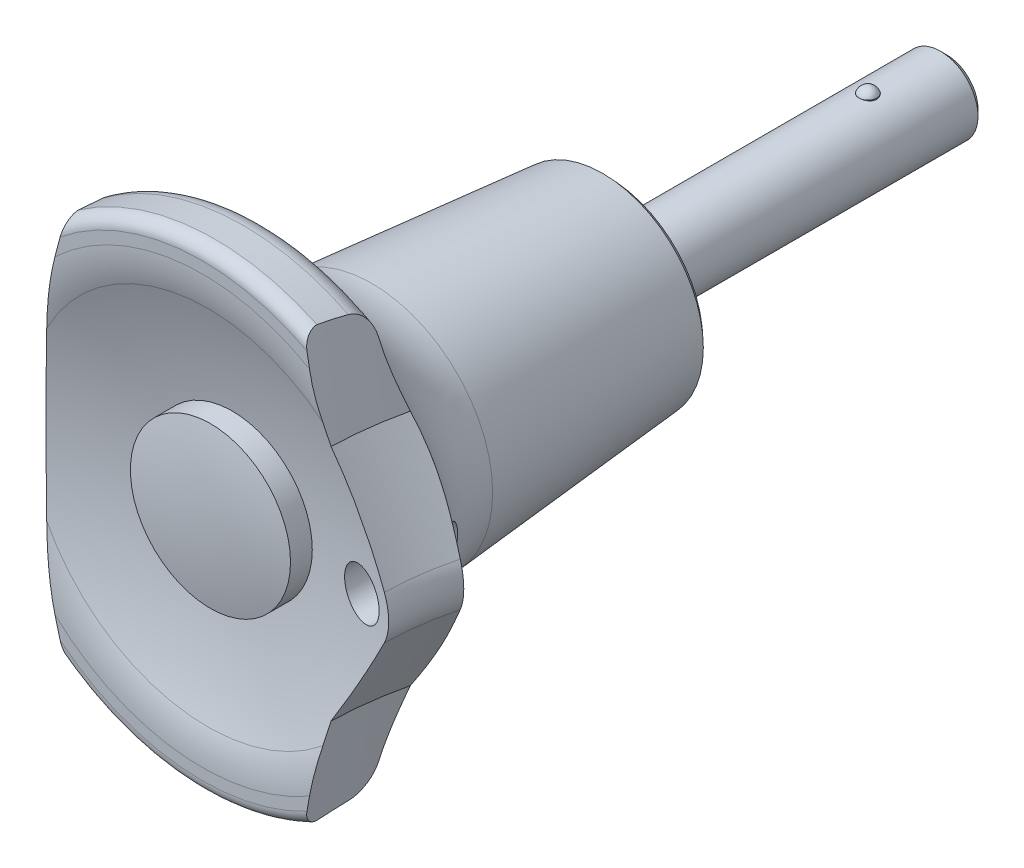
ISO-10303-21;
HEADER;
FILE_DESCRIPTION(('STEP AP214'),'2;1');
FILE_NAME('part.step','',(''),(''),'','','');
FILE_SCHEMA(('AUTOMOTIVE_DESIGN { 1 0 10303 214 1 1 1 1 }'));
ENDSEC;
DATA;
#1=APPLICATION_CONTEXT('core data for automotive mechanical design processes');
#2=APPLICATION_PROTOCOL_DEFINITION('international standard','automotive_design',2000,#1);
#3=PRODUCT_CONTEXT('',#1,'mechanical');
#4=PRODUCT('Part','Part','',(#3));
#5=PRODUCT_RELATED_PRODUCT_CATEGORY('part','',(#4));
#6=PRODUCT_DEFINITION_FORMATION('','',#4);
#7=PRODUCT_DEFINITION_CONTEXT('part definition',#1,'design');
#8=PRODUCT_DEFINITION('design','',#6,#7);
#9=PRODUCT_DEFINITION_SHAPE('','',#8);
#10=(LENGTH_UNIT() NAMED_UNIT(*) SI_UNIT(.MILLI.,.METRE.));
#11=(NAMED_UNIT(*) PLANE_ANGLE_UNIT() SI_UNIT($,.RADIAN.));
#12=(NAMED_UNIT(*) SI_UNIT($,.STERADIAN.) SOLID_ANGLE_UNIT());
#13=UNCERTAINTY_MEASURE_WITH_UNIT(LENGTH_MEASURE(1.E-05),#10,'distance_accuracy_value','');
#14=(GEOMETRIC_REPRESENTATION_CONTEXT(3) GLOBAL_UNCERTAINTY_ASSIGNED_CONTEXT((#13)) GLOBAL_UNIT_ASSIGNED_CONTEXT((#10,
#11,#12)) REPRESENTATION_CONTEXT('',''));
#15=CARTESIAN_POINT('',(0.,0.,0.));
#16=DIRECTION('',(0.,0.,1.));
#17=DIRECTION('',(1.,0.,0.));
#18=AXIS2_PLACEMENT_3D('',#15,#16,#17);
#19=CARTESIAN_POINT('',(0.,2.76,-20.7));
#20=DIRECTION('',(1.,0.,0.));
#21=DIRECTION('',(0.,1.,0.));
#22=AXIS2_PLACEMENT_3D('',#19,#20,#21);
#23=SPHERICAL_SURFACE('',#22,0.74);
#24=CARTESIAN_POINT('',(0.,3.,-20.6999999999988));
#25=DIRECTION('',(0.,1.,3.9331195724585E-13));
#26=DIRECTION('',(0.,-3.9331195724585E-13,1.));
#27=AXIS2_PLACEMENT_3D('',#24,#25,#26);
#28=CIRCLE('',#27,0.7);
#29=CARTESIAN_POINT('',(0.,2.99999999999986,-19.9999999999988));
#30=VERTEX_POINT('',#29);
#31=CARTESIAN_POINT('',(0.,2.99999999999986,-21.3999999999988));
#32=VERTEX_POINT('',#31);
#33=EDGE_CURVE('E750',#30,#32,#28,.F.);
#34=ORIENTED_EDGE('',*,*,#33,.F.);
#35=CARTESIAN_POINT('',(0.,2.99999999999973,-20.6999999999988));
#36=DIRECTION('',(0.,1.,3.9331195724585E-13));
#37=DIRECTION('',(0.,-3.9331195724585E-13,1.));
#38=AXIS2_PLACEMENT_3D('',#35,#36,#37);
#39=CIRCLE('',#38,0.7);
#40=EDGE_CURVE('E745',#32,#30,#39,.F.);
#41=ORIENTED_EDGE('',*,*,#40,.F.);
#42=EDGE_LOOP('',(#34,#41));
#43=FACE_BOUND('',#42,.T.);
#44=ADVANCED_FACE('F14',(#43),#23,.T.);
#45=CARTESIAN_POINT('',(0.,-2.76,-20.7));
#46=DIRECTION('',(1.,0.,0.));
#47=DIRECTION('',(0.,1.,0.));
#48=AXIS2_PLACEMENT_3D('',#45,#46,#47);
#49=SPHERICAL_SURFACE('',#48,0.74);
#50=CARTESIAN_POINT('',(0.,-3.00000000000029,-20.7000000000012));
#51=DIRECTION('',(0.,1.,3.9331195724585E-13));
#52=DIRECTION('',(0.,-3.9331195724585E-13,1.));
#53=AXIS2_PLACEMENT_3D('',#50,#51,#52);
#54=CIRCLE('',#53,0.7);
#55=CARTESIAN_POINT('',(0.,-3.00000000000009,-21.4000000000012));
#56=VERTEX_POINT('',#55);
#57=CARTESIAN_POINT('',(0.,-3.00000000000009,-20.0000000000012));
#58=VERTEX_POINT('',#57);
#59=EDGE_CURVE('E33',#56,#58,#54,.T.);
#60=ORIENTED_EDGE('',*,*,#59,.F.);
#61=CARTESIAN_POINT('',(0.,-2.99999999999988,-20.7000000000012));
#62=DIRECTION('',(0.,1.,3.9331195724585E-13));
#63=DIRECTION('',(0.,-3.9331195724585E-13,1.));
#64=AXIS2_PLACEMENT_3D('',#61,#62,#63);
#65=CIRCLE('',#64,0.7);
#66=EDGE_CURVE('E753',#58,#56,#65,.T.);
#67=ORIENTED_EDGE('',*,*,#66,.F.);
#68=EDGE_LOOP('',(#60,#67));
#69=FACE_BOUND('',#68,.T.);
#70=ADVANCED_FACE('F760',(#69),#49,.T.);
#71=CARTESIAN_POINT('',(0.,0.,-20.7));
#72=DIRECTION('',(0.,1.,3.9331195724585E-13));
#73=DIRECTION('',(0.,-3.9331195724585E-13,1.));
#74=AXIS2_PLACEMENT_3D('',#71,#72,#73);
#75=CYLINDRICAL_SURFACE('',#74,0.7);
#76=CARTESIAN_POINT('',(0.,-3.00000000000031,-21.4000000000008));
#77=CARTESIAN_POINT('',(-0.0388250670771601,-3.00002806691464,-21.4000358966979));
#78=CARTESIAN_POINT('',(-0.0776289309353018,-2.99924718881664,-21.3967722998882));
#79=CARTESIAN_POINT('',(-0.154051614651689,-2.99627816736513,-21.3839246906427));
#80=CARTESIAN_POINT('',(-0.191672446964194,-2.99409256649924,-21.3743520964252));
#81=CARTESIAN_POINT('',(-0.264735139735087,-2.98852325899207,-21.3491629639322));
#82=CARTESIAN_POINT('',(-0.300176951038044,-2.98513952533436,-21.3335462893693));
#83=CARTESIAN_POINT('',(-0.367944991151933,-2.97754553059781,-21.2967435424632));
#84=CARTESIAN_POINT('',(-0.400270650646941,-2.97333511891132,-21.2755564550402));
#85=CARTESIAN_POINT('',(-0.461461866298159,-2.96446054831,-21.2278099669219));
#86=CARTESIAN_POINT('',(-0.490263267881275,-2.95979017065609,-21.2011694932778));
#87=CARTESIAN_POINT('',(-0.543034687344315,-2.95056475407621,-21.1434443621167));
#88=CARTESIAN_POINT('',(-0.567003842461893,-2.94600973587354,-21.1123589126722));
#89=CARTESIAN_POINT('',(-0.609720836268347,-2.93746875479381,-21.046139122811));
#90=CARTESIAN_POINT('',(-0.62839832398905,-2.93349077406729,-21.0109582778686));
#91=CARTESIAN_POINT('',(-0.659549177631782,-2.92664499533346,-20.937850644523));
#92=CARTESIAN_POINT('',(-0.672023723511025,-2.92377698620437,-20.899924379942));
#93=CARTESIAN_POINT('',(-0.690199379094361,-2.91953955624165,-20.8231061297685));
#94=CARTESIAN_POINT('',(-0.696015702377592,-2.91814467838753,-20.7842428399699));
#95=CARTESIAN_POINT('',(-0.701068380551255,-2.91693510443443,-20.706068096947));
#96=CARTESIAN_POINT('',(-0.700305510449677,-2.917120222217,-20.6667566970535));
#97=CARTESIAN_POINT('',(-0.69231356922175,-2.91902680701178,-20.5896718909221));
#98=CARTESIAN_POINT('',(-0.685220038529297,-2.9207160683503,-20.5518835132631));
#99=CARTESIAN_POINT('',(-0.664983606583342,-2.92538948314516,-20.4780487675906));
#100=CARTESIAN_POINT('',(-0.651840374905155,-2.92837370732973,-20.4420024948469));
#101=CARTESIAN_POINT('',(-0.619757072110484,-2.93533159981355,-20.3723012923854));
#102=CARTESIAN_POINT('',(-0.600766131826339,-2.93931389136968,-20.3386706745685));
#103=CARTESIAN_POINT('',(-0.557562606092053,-2.94781397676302,-20.2750249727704));
#104=CARTESIAN_POINT('',(-0.533349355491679,-2.95233183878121,-20.2450103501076));
#105=CARTESIAN_POINT('',(-0.47968143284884,-2.96153060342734,-20.188672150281));
#106=CARTESIAN_POINT('',(-0.450112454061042,-2.96621278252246,-20.1624575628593));
#107=CARTESIAN_POINT('',(-0.386934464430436,-2.97511303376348,-20.1153336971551));
#108=CARTESIAN_POINT('',(-0.353324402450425,-2.97933098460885,-20.0944258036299));
#109=CARTESIAN_POINT('',(-0.282870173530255,-2.9868450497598,-20.0584749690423));
#110=CARTESIAN_POINT('',(-0.246015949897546,-2.99013815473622,-20.0434511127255));
#111=CARTESIAN_POINT('',(-0.170234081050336,-2.99540575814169,-20.0198604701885));
#112=CARTESIAN_POINT('',(-0.131309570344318,-2.99738219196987,-20.0112842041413));
#113=CARTESIAN_POINT('',(-0.0767145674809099,-2.99905826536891,-20.0040453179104));
#114=CARTESIAN_POINT('',(-0.0613998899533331,-2.99941099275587,-20.0025279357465));
#115=CARTESIAN_POINT('',(-0.0307258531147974,-2.99988170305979,-20.0005064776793));
#116=CARTESIAN_POINT('',(-0.0153666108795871,-3.00000007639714,-20.0000007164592));
#117=CARTESIAN_POINT('',(0.,-3.,-20.0000000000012));
#118=B_SPLINE_CURVE_WITH_KNOTS('',3,(#76,#77,#78,#79,#80,#81,#82,#83,#84,#85,#86,#87,#88,#89,
#90,#91,#92,#93,#94,#95,#96,#97,#98,#99,#100,#101,#102,#103,#104,#105,#106,#107,#108,#109,#110,
#111,#112,#113,#114,#115,#116,#117),.UNSPECIFIED.,.F.,.F.,(4,2,2,2,2,2,2,2,2,2,2,2,2,2,2,2,2,2,
2,2,4),(0.,0.116298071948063,0.232386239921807,0.348477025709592,0.464588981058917,
0.582572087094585,0.700576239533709,0.82008257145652,0.93956616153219,1.05694938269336,
1.17431877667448,1.28923400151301,1.40415550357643,1.52010638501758,1.63607204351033,
1.75489104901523,1.87374102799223,1.99297336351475,2.11203004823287,2.15818339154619,
2.20425978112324),.UNSPECIFIED.);
#119=EDGE_CURVE('E715',#56,#58,#118,.T.);
#120=ORIENTED_EDGE('',*,*,#119,.F.);
#121=ORIENTED_EDGE('',*,*,#59,.T.);
#122=EDGE_LOOP('',(#120,#121));
#123=FACE_BOUND('',#122,.T.);
#124=ADVANCED_FACE('F733',(#123),#75,.T.);
#125=CARTESIAN_POINT('',(0.,0.,-20.7));
#126=DIRECTION('',(0.,1.,3.9331195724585E-13));
#127=DIRECTION('',(0.,-3.9331195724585E-13,1.));
#128=AXIS2_PLACEMENT_3D('',#125,#126,#127);
#129=CYLINDRICAL_SURFACE('',#128,0.7);
#130=CARTESIAN_POINT('',(0.,3.00000000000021,-19.9999999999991));
#131=CARTESIAN_POINT('',(-0.038825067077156,3.0000280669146,-19.9999641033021));
#132=CARTESIAN_POINT('',(-0.0776289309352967,2.99924718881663,-20.0032277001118));
#133=CARTESIAN_POINT('',(-0.154051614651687,2.99627816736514,-20.0160753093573));
#134=CARTESIAN_POINT('',(-0.191672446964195,2.99409256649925,-20.0256479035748));
#135=CARTESIAN_POINT('',(-0.26473513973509,2.98852325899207,-20.0508370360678));
#136=CARTESIAN_POINT('',(-0.300176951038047,2.98513952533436,-20.0664537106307));
#137=CARTESIAN_POINT('',(-0.367944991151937,2.97754553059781,-20.1032564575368));
#138=CARTESIAN_POINT('',(-0.400270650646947,2.97333511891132,-20.1244435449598));
#139=CARTESIAN_POINT('',(-0.461461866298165,2.96446054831,-20.1721900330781));
#140=CARTESIAN_POINT('',(-0.490263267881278,2.95979017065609,-20.1988305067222));
#141=CARTESIAN_POINT('',(-0.543034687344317,2.95056475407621,-20.2565556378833));
#142=CARTESIAN_POINT('',(-0.567003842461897,2.94600973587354,-20.2876410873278));
#143=CARTESIAN_POINT('',(-0.60972083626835,2.93746875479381,-20.353860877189));
#144=CARTESIAN_POINT('',(-0.628398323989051,2.93349077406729,-20.3890417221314));
#145=CARTESIAN_POINT('',(-0.659549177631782,2.92664499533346,-20.462149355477));
#146=CARTESIAN_POINT('',(-0.672023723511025,2.92377698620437,-20.500075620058));
#147=CARTESIAN_POINT('',(-0.690199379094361,2.91953955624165,-20.5768938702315));
#148=CARTESIAN_POINT('',(-0.696015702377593,2.91814467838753,-20.6157571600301));
#149=CARTESIAN_POINT('',(-0.701068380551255,2.91693510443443,-20.693931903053));
#150=CARTESIAN_POINT('',(-0.700305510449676,2.917120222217,-20.7332433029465));
#151=CARTESIAN_POINT('',(-0.692313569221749,2.91902680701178,-20.8103281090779));
#152=CARTESIAN_POINT('',(-0.685220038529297,2.9207160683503,-20.8481164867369));
#153=CARTESIAN_POINT('',(-0.664983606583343,2.92538948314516,-20.9219512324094));
#154=CARTESIAN_POINT('',(-0.651840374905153,2.92837370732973,-20.9579975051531));
#155=CARTESIAN_POINT('',(-0.619757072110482,2.93533159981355,-21.0276987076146));
#156=CARTESIAN_POINT('',(-0.60076613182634,2.93931389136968,-21.0613293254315));
#157=CARTESIAN_POINT('',(-0.557562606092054,2.94781397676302,-21.1249750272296));
#158=CARTESIAN_POINT('',(-0.533349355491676,2.95233183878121,-21.1549896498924));
#159=CARTESIAN_POINT('',(-0.479681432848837,2.96153060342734,-21.211327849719));
#160=CARTESIAN_POINT('',(-0.45011245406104,2.96621278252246,-21.2375424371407));
#161=CARTESIAN_POINT('',(-0.386934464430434,2.97511303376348,-21.2846663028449));
#162=CARTESIAN_POINT('',(-0.353324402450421,2.97933098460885,-21.3055741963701));
#163=CARTESIAN_POINT('',(-0.282870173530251,2.9868450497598,-21.3415250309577));
#164=CARTESIAN_POINT('',(-0.246015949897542,2.99013815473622,-21.3565488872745));
#165=CARTESIAN_POINT('',(-0.170234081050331,2.99540575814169,-21.3801395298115));
#166=CARTESIAN_POINT('',(-0.131309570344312,2.99738219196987,-21.3887157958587));
#167=CARTESIAN_POINT('',(-0.0767145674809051,2.99905826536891,-21.3959546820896));
#168=CARTESIAN_POINT('',(-0.0613998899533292,2.99941099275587,-21.3974720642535));
#169=CARTESIAN_POINT('',(-0.0307258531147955,2.99988170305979,-21.3994935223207));
#170=CARTESIAN_POINT('',(-0.0153666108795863,3.00000007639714,-21.3999992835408));
#171=CARTESIAN_POINT('',(0.,3.,-21.3999999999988));
#172=B_SPLINE_CURVE_WITH_KNOTS('',3,(#130,#131,#132,#133,#134,#135,#136,#137,#138,#139,#140,
#141,#142,#143,#144,#145,#146,#147,#148,#149,#150,#151,#152,#153,#154,#155,#156,#157,#158,#159,
#160,#161,#162,#163,#164,#165,#166,#167,#168,#169,#170,#171),.UNSPECIFIED.,.F.,.F.,(4,2,2,2,2,2,
2,2,2,2,2,2,2,2,2,2,2,2,2,2,4),(0.,0.116298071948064,0.232386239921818,0.348477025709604,
0.464588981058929,0.582572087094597,0.700576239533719,0.820082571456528,0.939566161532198,
1.05694938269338,1.17431877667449,1.28923400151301,1.40415550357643,1.52010638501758,
1.63607204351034,1.75489104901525,1.87374102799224,1.99297336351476,2.11203004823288,
2.1581833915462,2.20425978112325),.UNSPECIFIED.);
#173=EDGE_CURVE('E712',#30,#32,#172,.T.);
#174=ORIENTED_EDGE('',*,*,#173,.F.);
#175=ORIENTED_EDGE('',*,*,#33,.T.);
#176=EDGE_LOOP('',(#174,#175));
#177=FACE_BOUND('',#176,.T.);
#178=ADVANCED_FACE('F729',(#177),#129,.T.);
#179=CARTESIAN_POINT('',(0.,1.25,-27.));
#180=DIRECTION('',(0.,0.,-1.));
#181=DIRECTION('',(-1.,0.,0.));
#182=AXIS2_PLACEMENT_3D('',#179,#180,#181);
#183=PLANE('',#182);
#184=CARTESIAN_POINT('',(0.,0.,-27.0000000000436));
#185=DIRECTION('',(0.,0.,1.));
#186=DIRECTION('',(1.,0.,0.));
#187=AXIS2_PLACEMENT_3D('',#184,#185,#186);
#188=CIRCLE('',#187,2.49999999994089);
#189=CARTESIAN_POINT('',(2.49999999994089,0.,-27.0000000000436));
#190=VERTEX_POINT('',#189);
#191=EDGE_CURVE('E710',#190,#190,#188,.T.);
#192=ORIENTED_EDGE('',*,*,#191,.F.);
#193=EDGE_LOOP('',(#192));
#194=FACE_BOUND('',#193,.T.);
#195=ADVANCED_FACE('F732',(#194),#183,.T.);
#196=CARTESIAN_POINT('',(0.,0.,-20.7));
#197=DIRECTION('',(0.,1.,3.9331195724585E-13));
#198=DIRECTION('',(0.,-3.9331195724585E-13,1.));
#199=AXIS2_PLACEMENT_3D('',#196,#197,#198);
#200=CYLINDRICAL_SURFACE('',#199,0.7);
#201=CARTESIAN_POINT('',(0.,3.,-21.3999999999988));
#202=CARTESIAN_POINT('',(0.0388250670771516,3.00002806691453,-21.4000358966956));
#203=CARTESIAN_POINT('',(0.0776289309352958,2.99924718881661,-21.3967722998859));
#204=CARTESIAN_POINT('',(0.154051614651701,2.99627816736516,-21.3839246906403));
#205=CARTESIAN_POINT('',(0.19167244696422,2.99409256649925,-21.3743520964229));
#206=CARTESIAN_POINT('',(0.264735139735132,2.98852325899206,-21.3491629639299));
#207=CARTESIAN_POINT('',(0.300176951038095,2.98513952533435,-21.3335462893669));
#208=CARTESIAN_POINT('',(0.367944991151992,2.9775455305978,-21.2967435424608));
#209=CARTESIAN_POINT('',(0.400270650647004,2.97333511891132,-21.2755564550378));
#210=CARTESIAN_POINT('',(0.461461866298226,2.96446054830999,-21.2278099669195));
#211=CARTESIAN_POINT('',(0.490263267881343,2.95979017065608,-21.2011694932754));
#212=CARTESIAN_POINT('',(0.543034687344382,2.9505647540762,-21.1434443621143));
#213=CARTESIAN_POINT('',(0.567003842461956,2.94600973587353,-21.1123589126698));
#214=CARTESIAN_POINT('',(0.609720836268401,2.9374687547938,-21.0461391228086));
#215=CARTESIAN_POINT('',(0.628398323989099,2.93349077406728,-21.0109582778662));
#216=CARTESIAN_POINT('',(0.659549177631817,2.92664499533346,-20.9378506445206));
#217=CARTESIAN_POINT('',(0.672023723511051,2.92377698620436,-20.8999243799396));
#218=CARTESIAN_POINT('',(0.690199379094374,2.91953955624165,-20.8231061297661));
#219=CARTESIAN_POINT('',(0.696015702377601,2.91814467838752,-20.7842428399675));
#220=CARTESIAN_POINT('',(0.701068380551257,2.91693510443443,-20.7060680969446));
#221=CARTESIAN_POINT('',(0.700305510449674,2.917120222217,-20.6667566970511));
#222=CARTESIAN_POINT('',(0.692313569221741,2.91902680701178,-20.5896718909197));
#223=CARTESIAN_POINT('',(0.685220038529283,2.9207160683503,-20.5518835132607));
#224=CARTESIAN_POINT('',(0.664983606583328,2.92538948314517,-20.4780487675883));
#225=CARTESIAN_POINT('',(0.651840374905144,2.92837370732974,-20.4420024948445));
#226=CARTESIAN_POINT('',(0.619757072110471,2.93533159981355,-20.3723012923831));
#227=CARTESIAN_POINT('',(0.600766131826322,2.93931389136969,-20.3386706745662));
#228=CARTESIAN_POINT('',(0.55756260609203,2.94781397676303,-20.2750249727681));
#229=CARTESIAN_POINT('',(0.533349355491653,2.95233183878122,-20.2450103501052));
#230=CARTESIAN_POINT('',(0.479681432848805,2.96153060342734,-20.1886721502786));
#231=CARTESIAN_POINT('',(0.450112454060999,2.96621278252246,-20.162457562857));
#232=CARTESIAN_POINT('',(0.386934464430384,2.97511303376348,-20.1153336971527));
#233=CARTESIAN_POINT('',(0.35332440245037,2.97933098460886,-20.0944258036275));
#234=CARTESIAN_POINT('',(0.282870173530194,2.98684504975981,-20.0584749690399));
#235=CARTESIAN_POINT('',(0.246015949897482,2.99013815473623,-20.0434511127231));
#236=CARTESIAN_POINT('',(0.170234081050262,2.99540575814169,-20.0198604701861));
#237=CARTESIAN_POINT('',(0.131309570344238,2.99738219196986,-20.011284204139));
#238=CARTESIAN_POINT('',(0.0767145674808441,2.99905826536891,-20.004045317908));
#239=CARTESIAN_POINT('',(0.0613998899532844,2.99941099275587,-20.0025279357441));
#240=CARTESIAN_POINT('',(0.0307258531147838,2.99988170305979,-20.0005064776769));
#241=CARTESIAN_POINT('',(0.0153666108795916,3.00000007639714,-20.0000007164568));
#242=CARTESIAN_POINT('',(0.,3.,-19.9999999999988));
#243=B_SPLINE_CURVE_WITH_KNOTS('',3,(#201,#202,#203,#204,#205,#206,#207,#208,#209,#210,#211,
#212,#213,#214,#215,#216,#217,#218,#219,#220,#221,#222,#223,#224,#225,#226,#227,#228,#229,#230,
#231,#232,#233,#234,#235,#236,#237,#238,#239,#240,#241,#242),.UNSPECIFIED.,.F.,.F.,(4,2,2,2,2,2,
2,2,2,2,2,2,2,2,2,2,2,2,2,2,4),(0.,0.116298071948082,0.232386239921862,0.348477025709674,
0.464588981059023,0.582572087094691,0.70057623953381,0.820082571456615,0.939566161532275,
1.05694938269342,1.17431877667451,1.28923400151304,1.40415550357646,1.52010638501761,
1.63607204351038,1.75489104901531,1.87374102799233,1.99297336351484,2.11203004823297,
2.15818339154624,2.20425978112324),.UNSPECIFIED.);
#244=EDGE_CURVE('E677',#32,#30,#243,.T.);
#245=ORIENTED_EDGE('',*,*,#244,.F.);
#246=ORIENTED_EDGE('',*,*,#40,.T.);
#247=EDGE_LOOP('',(#245,#246));
#248=FACE_BOUND('',#247,.T.);
#249=ADVANCED_FACE('F697',(#248),#200,.T.);
#250=CARTESIAN_POINT('',(0.,0.,-20.7));
#251=DIRECTION('',(0.,1.,3.9331195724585E-13));
#252=DIRECTION('',(0.,-3.9331195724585E-13,1.));
#253=AXIS2_PLACEMENT_3D('',#250,#251,#252);
#254=CYLINDRICAL_SURFACE('',#253,0.7);
#255=CARTESIAN_POINT('',(0.,-3.,-20.0000000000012));
#256=CARTESIAN_POINT('',(0.0388250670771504,-3.00002806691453,-19.9999641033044));
#257=CARTESIAN_POINT('',(0.0776289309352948,-2.99924718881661,-20.0032277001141));
#258=CARTESIAN_POINT('',(0.154051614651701,-2.99627816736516,-20.0160753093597));
#259=CARTESIAN_POINT('',(0.19167244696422,-2.99409256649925,-20.0256479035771));
#260=CARTESIAN_POINT('',(0.264735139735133,-2.98852325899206,-20.0508370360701));
#261=CARTESIAN_POINT('',(0.300176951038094,-2.98513952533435,-20.0664537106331));
#262=CARTESIAN_POINT('',(0.367944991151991,-2.9775455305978,-20.1032564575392));
#263=CARTESIAN_POINT('',(0.400270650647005,-2.97333511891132,-20.1244435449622));
#264=CARTESIAN_POINT('',(0.461461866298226,-2.96446054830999,-20.1721900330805));
#265=CARTESIAN_POINT('',(0.490263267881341,-2.95979017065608,-20.1988305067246));
#266=CARTESIAN_POINT('',(0.543034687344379,-2.9505647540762,-20.2565556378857));
#267=CARTESIAN_POINT('',(0.567003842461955,-2.94600973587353,-20.2876410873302));
#268=CARTESIAN_POINT('',(0.609720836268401,-2.9374687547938,-20.3538608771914));
#269=CARTESIAN_POINT('',(0.628398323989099,-2.93349077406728,-20.3890417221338));
#270=CARTESIAN_POINT('',(0.659549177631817,-2.92664499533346,-20.4621493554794));
#271=CARTESIAN_POINT('',(0.672023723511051,-2.92377698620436,-20.5000756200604));
#272=CARTESIAN_POINT('',(0.690199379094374,-2.91953955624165,-20.5768938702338));
#273=CARTESIAN_POINT('',(0.696015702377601,-2.91814467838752,-20.6157571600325));
#274=CARTESIAN_POINT('',(0.701068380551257,-2.91693510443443,-20.6939319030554));
#275=CARTESIAN_POINT('',(0.700305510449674,-2.917120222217,-20.7332433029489));
#276=CARTESIAN_POINT('',(0.692313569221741,-2.91902680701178,-20.8103281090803));
#277=CARTESIAN_POINT('',(0.685220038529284,-2.9207160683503,-20.8481164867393));
#278=CARTESIAN_POINT('',(0.664983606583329,-2.92538948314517,-20.9219512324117));
#279=CARTESIAN_POINT('',(0.651840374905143,-2.92837370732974,-20.9579975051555));
#280=CARTESIAN_POINT('',(0.61975707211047,-2.93533159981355,-21.0276987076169));
#281=CARTESIAN_POINT('',(0.600766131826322,-2.93931389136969,-21.0613293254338));
#282=CARTESIAN_POINT('',(0.55756260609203,-2.94781397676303,-21.1249750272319));
#283=CARTESIAN_POINT('',(0.533349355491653,-2.95233183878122,-21.1549896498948));
#284=CARTESIAN_POINT('',(0.479681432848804,-2.96153060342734,-21.2113278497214));
#285=CARTESIAN_POINT('',(0.450112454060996,-2.96621278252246,-21.237542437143));
#286=CARTESIAN_POINT('',(0.386934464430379,-2.97511303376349,-21.2846663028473));
#287=CARTESIAN_POINT('',(0.353324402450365,-2.97933098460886,-21.3055741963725));
#288=CARTESIAN_POINT('',(0.282870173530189,-2.98684504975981,-21.3415250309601));
#289=CARTESIAN_POINT('',(0.246015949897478,-2.99013815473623,-21.3565488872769));
#290=CARTESIAN_POINT('',(0.170234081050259,-2.99540575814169,-21.3801395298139));
#291=CARTESIAN_POINT('',(0.131309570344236,-2.99738219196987,-21.388715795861));
#292=CARTESIAN_POINT('',(0.0767145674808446,-2.99905826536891,-21.395954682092));
#293=CARTESIAN_POINT('',(0.0613998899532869,-2.99941099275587,-21.3974720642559));
#294=CARTESIAN_POINT('',(0.0307258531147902,-2.99988170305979,-21.3994935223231));
#295=CARTESIAN_POINT('',(0.0153666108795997,-3.00000007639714,-21.3999992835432));
#296=CARTESIAN_POINT('',(0.,-3.,-21.4000000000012));
#297=B_SPLINE_CURVE_WITH_KNOTS('',3,(#255,#256,#257,#258,#259,#260,#261,#262,#263,#264,#265,
#266,#267,#268,#269,#270,#271,#272,#273,#274,#275,#276,#277,#278,#279,#280,#281,#282,#283,#284,
#285,#286,#287,#288,#289,#290,#291,#292,#293,#294,#295,#296),.UNSPECIFIED.,.F.,.F.,(4,2,2,2,2,2,
2,2,2,2,2,2,2,2,2,2,2,2,2,2,4),(0.,0.116298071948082,0.232386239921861,0.348477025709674,
0.464588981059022,0.582572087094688,0.700576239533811,0.820082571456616,0.939566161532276,
1.05694938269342,1.17431877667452,1.28923400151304,1.40415550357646,1.52010638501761,
1.63607204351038,1.75489104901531,1.87374102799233,1.99297336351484,2.11203004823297,
2.15818339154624,2.20425978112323),.UNSPECIFIED.);
#298=EDGE_CURVE('E672',#58,#56,#297,.T.);
#299=ORIENTED_EDGE('',*,*,#298,.F.);
#300=ORIENTED_EDGE('',*,*,#66,.T.);
#301=EDGE_LOOP('',(#299,#300));
#302=FACE_BOUND('',#301,.T.);
#303=ADVANCED_FACE('F693',(#302),#254,.T.);
#304=CARTESIAN_POINT('',(0.,0.,-26.5000000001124));
#305=DIRECTION('',(0.,0.,1.));
#306=DIRECTION('',(1.,0.,0.));
#307=AXIS2_PLACEMENT_3D('',#304,#305,#306);
#308=CONICAL_SURFACE('',#307,2.99999999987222,0.785398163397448);
#309=ORIENTED_EDGE('',*,*,#191,.T.);
#310=EDGE_LOOP('',(#309));
#311=FACE_BOUND('',#310,.T.);
#312=CARTESIAN_POINT('',(0.,0.,-26.5));
#313=DIRECTION('',(0.,0.,1.));
#314=DIRECTION('',(1.,0.,0.));
#315=AXIS2_PLACEMENT_3D('',#312,#313,#314);
#316=CIRCLE('',#315,3.);
#317=CARTESIAN_POINT('',(3.,0.,-26.5));
#318=VERTEX_POINT('',#317);
#319=EDGE_CURVE('E669',#318,#318,#316,.T.);
#320=ORIENTED_EDGE('',*,*,#319,.F.);
#321=EDGE_LOOP('',(#320));
#322=FACE_BOUND('',#321,.T.);
#323=ADVANCED_FACE('F696',(#311,#322),#308,.T.);
#324=CARTESIAN_POINT('',(0.,0.,-5.125));
#325=DIRECTION('',(0.,0.,1.));
#326=DIRECTION('',(1.,0.,0.));
#327=AXIS2_PLACEMENT_3D('',#324,#325,#326);
#328=CYLINDRICAL_SURFACE('',#327,3.);
#329=CARTESIAN_POINT('',(0.,0.,0.));
#330=DIRECTION('',(0.,0.,-1.));
#331=DIRECTION('',(-1.,0.,0.));
#332=AXIS2_PLACEMENT_3D('',#329,#330,#331);
#333=CIRCLE('',#332,3.);
#334=CARTESIAN_POINT('',(-3.,0.,0.));
#335=VERTEX_POINT('',#334);
#336=EDGE_CURVE('E665',#335,#335,#333,.F.);
#337=ORIENTED_EDGE('',*,*,#336,.F.);
#338=EDGE_LOOP('',(#337));
#339=FACE_BOUND('',#338,.T.);
#340=ORIENTED_EDGE('',*,*,#173,.T.);
#341=ORIENTED_EDGE('',*,*,#244,.T.);
#342=EDGE_LOOP('',(#340,#341));
#343=FACE_BOUND('',#342,.T.);
#344=ORIENTED_EDGE('',*,*,#119,.T.);
#345=ORIENTED_EDGE('',*,*,#298,.T.);
#346=EDGE_LOOP('',(#344,#345));
#347=FACE_BOUND('',#346,.T.);
#348=ORIENTED_EDGE('',*,*,#319,.T.);
#349=EDGE_LOOP('',(#348));
#350=FACE_BOUND('',#349,.T.);
#351=ADVANCED_FACE('F601',(#339,#343,#347,#350),#328,.T.);
#352=CARTESIAN_POINT('',(0.,0.,31.5));
#353=DIRECTION('',(0.,0.,1.));
#354=DIRECTION('',(1.,0.,0.));
#355=AXIS2_PLACEMENT_3D('',#352,#353,#354);
#356=CONICAL_SURFACE('',#355,19.,0.0872664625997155);
#357=CARTESIAN_POINT('',(-11.2367166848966,-15.0725210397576,29.2154159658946));
#358=CARTESIAN_POINT('',(-11.2176777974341,-15.0969210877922,29.3089473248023));
#359=CARTESIAN_POINT('',(-11.1992554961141,-15.1208018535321,29.4027394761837));
#360=CARTESIAN_POINT('',(-11.1636714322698,-15.1675195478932,29.5907332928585));
#361=CARTESIAN_POINT('',(-11.1465086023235,-15.1903573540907,29.6849345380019));
#362=CARTESIAN_POINT('',(-11.1134475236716,-15.2350129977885,29.8737414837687));
#363=CARTESIAN_POINT('',(-11.0975485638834,-15.2568314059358,29.9683469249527));
#364=CARTESIAN_POINT('',(-11.0670196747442,-15.2994695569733,30.1579580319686));
#365=CARTESIAN_POINT('',(-11.0523893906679,-15.3202895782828,30.2529635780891));
#366=CARTESIAN_POINT('',(-11.0244032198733,-15.3609498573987,30.4433702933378));
#367=CARTESIAN_POINT('',(-11.0110473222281,-15.3807901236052,30.5387714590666));
#368=CARTESIAN_POINT('',(-10.9856156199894,-15.4195080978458,30.7299680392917));
#369=CARTESIAN_POINT('',(-10.973540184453,-15.4383855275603,30.8257635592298));
#370=CARTESIAN_POINT('',(-10.9506761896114,-15.4751926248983,31.0177468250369));
#371=CARTESIAN_POINT('',(-10.9398883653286,-15.4931217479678,31.1139347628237));
#372=CARTESIAN_POINT('',(-10.9196071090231,-15.5280445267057,31.3067014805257));
#373=CARTESIAN_POINT('',(-10.9101147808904,-15.5450373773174,31.4032805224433));
#374=CARTESIAN_POINT('',(-10.9012791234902,-15.5615588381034,31.5));
#375=B_SPLINE_CURVE_WITH_KNOTS('',3,(#357,#358,#359,#360,#361,#362,#363,#364,#365,#366,#367,
#368,#369,#370,#371,#372,#373,#374),.UNSPECIFIED.,.F.,.F.,(4,2,2,2,2,2,2,2,4),(0.,
0.295552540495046,0.59085163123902,0.885983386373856,1.18103235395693,1.47607879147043,
1.77121003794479,2.06650896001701,2.36205795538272),.UNSPECIFIED.);
#376=CARTESIAN_POINT('',(-11.2367166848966,-15.0725210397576,29.2154159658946));
#377=VERTEX_POINT('',#376);
#378=CARTESIAN_POINT('',(-10.9012791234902,-15.5615588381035,31.5));
#379=VERTEX_POINT('',#378);
#380=EDGE_CURVE('E571',#377,#379,#375,.T.);
#381=ORIENTED_EDGE('',*,*,#380,.F.);
#382=CARTESIAN_POINT('',(0.,0.,29.2154159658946));
#383=DIRECTION('',(0.,0.,1.));
#384=DIRECTION('',(1.,0.,0.));
#385=AXIS2_PLACEMENT_3D('',#382,#383,#384);
#386=CIRCLE('',#385,18.8001247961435);
#387=CARTESIAN_POINT('',(8.39031074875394,-16.8240119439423,29.2154159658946));
#388=VERTEX_POINT('',#387);
#389=EDGE_CURVE('E243',#388,#377,#386,.F.);
#390=ORIENTED_EDGE('',*,*,#389,.F.);
#391=CARTESIAN_POINT('',(8.39031074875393,-16.8240119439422,29.2154159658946));
#392=CARTESIAN_POINT('',(8.36371883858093,-16.8557405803,29.4043278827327));
#393=CARTESIAN_POINT('',(8.3391092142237,-16.8864008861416,29.5936974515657));
#394=CARTESIAN_POINT('',(8.29388552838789,-16.9456264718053,29.9731315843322));
#395=CARTESIAN_POINT('',(8.27326927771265,-16.9741928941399,30.1631957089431));
#396=CARTESIAN_POINT('',(8.23603410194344,-17.0293070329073,30.544006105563));
#397=CARTESIAN_POINT('',(8.21941516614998,-17.0558547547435,30.7347523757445));
#398=CARTESIAN_POINT('',(8.19018148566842,-17.1069883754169,31.1169213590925));
#399=CARTESIAN_POINT('',(8.17756894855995,-17.1315731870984,31.3083443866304));
#400=CARTESIAN_POINT('',(8.16697223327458,-17.155190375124,31.4999976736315));
#401=B_SPLINE_CURVE_WITH_KNOTS('',3,(#391,#392,#393,#394,#395,#396,#397,#398,#399,#400),
.UNSPECIFIED.,.F.,.F.,(4,2,2,2,4),(0.,0.580169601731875,1.16002024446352,1.7398693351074,
2.32003737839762),.UNSPECIFIED.);
#402=CARTESIAN_POINT('',(8.16697214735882,-17.1551906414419,31.4999988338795));
#403=VERTEX_POINT('',#402);
#404=EDGE_CURVE('E174',#388,#403,#401,.T.);
#405=ORIENTED_EDGE('',*,*,#404,.T.);
#406=CARTESIAN_POINT('',(0.,0.,31.5));
#407=DIRECTION('',(0.,0.,1.));
#408=DIRECTION('',(1.,0.,0.));
#409=AXIS2_PLACEMENT_3D('',#406,#407,#408);
#410=CIRCLE('',#409,19.);
#411=EDGE_CURVE('E469',#379,#403,#410,.T.);
#412=ORIENTED_EDGE('',*,*,#411,.F.);
#413=EDGE_LOOP('',(#381,#390,#405,#412));
#414=FACE_BOUND('',#413,.T.);
#415=ADVANCED_FACE('F598',(#414),#356,.T.);
#416=CARTESIAN_POINT('',(0.,0.,31.5));
#417=DIRECTION('',(0.,0.,1.));
#418=DIRECTION('',(1.,0.,0.));
#419=AXIS2_PLACEMENT_3D('',#416,#417,#418);
#420=TOROIDAL_SURFACE('',#419,18.,1.);
#421=CARTESIAN_POINT('',(8.16697219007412,-17.1551906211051,31.499997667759));
#422=CARTESIAN_POINT('',(8.16610411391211,-17.1556060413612,31.5236792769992));
#423=CARTESIAN_POINT('',(8.16544722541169,-17.1549841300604,31.5473747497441));
#424=CARTESIAN_POINT('',(8.16455688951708,-17.1516830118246,31.5946216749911));
#425=CARTESIAN_POINT('',(8.16432329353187,-17.1490045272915,31.6181731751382));
#426=CARTESIAN_POINT('',(8.16425861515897,-17.1379549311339,31.688092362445));
#427=CARTESIAN_POINT('',(8.16505301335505,-17.1265741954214,31.7340189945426));
#428=CARTESIAN_POINT('',(8.16821542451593,-17.0963987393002,31.8232098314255));
#429=CARTESIAN_POINT('',(8.17058197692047,-17.077610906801,31.8664764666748));
#430=CARTESIAN_POINT('',(8.17670292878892,-17.0335448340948,31.9494901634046));
#431=CARTESIAN_POINT('',(8.18045877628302,-17.008259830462,31.9892334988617));
#432=CARTESIAN_POINT('',(8.18937318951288,-16.9507343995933,32.0665851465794));
#433=CARTESIAN_POINT('',(8.19459729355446,-16.9181889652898,32.1039574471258));
#434=CARTESIAN_POINT('',(8.20607879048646,-16.8482742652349,32.1736619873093));
#435=CARTESIAN_POINT('',(8.21233651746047,-16.8109034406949,32.2059925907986));
#436=CARTESIAN_POINT('',(8.22684468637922,-16.7253510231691,32.2708321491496));
#437=CARTESIAN_POINT('',(8.23525121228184,-16.6764328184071,32.3023321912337));
#438=CARTESIAN_POINT('',(8.25285140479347,-16.5748004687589,32.3582132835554));
#439=CARTESIAN_POINT('',(8.26204594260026,-16.5220821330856,32.3825863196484));
#440=CARTESIAN_POINT('',(8.28291939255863,-16.4028452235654,32.4286926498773));
#441=CARTESIAN_POINT('',(8.29471820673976,-16.3357312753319,32.4488314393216));
#442=CARTESIAN_POINT('',(8.31870582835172,-16.1994743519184,32.4792714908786));
#443=CARTESIAN_POINT('',(8.33089427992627,-16.1303332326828,32.4895814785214));
#444=CARTESIAN_POINT('',(8.35033301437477,-16.020087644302,32.4983819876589));
#445=CARTESIAN_POINT('',(8.35754198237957,-15.9792076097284,32.4999965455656));
#446=CARTESIAN_POINT('',(8.36474497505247,-15.9383512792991,32.5));
#447=B_SPLINE_CURVE_WITH_KNOTS('',3,(#421,#422,#423,#424,#425,#426,#427,#428,#429,#430,#431,
#432,#433,#434,#435,#436,#437,#438,#439,#440,#441,#442,#443,#444,#445,#446),.UNSPECIFIED.,.F.,
.F.,(4,2,2,2,2,2,2,2,2,2,2,2,4),(0.,0.071056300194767,0.142087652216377,0.283279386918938,
0.424340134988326,0.565548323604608,0.714487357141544,0.863474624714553,1.03919502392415,
1.21511226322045,1.42749571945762,1.63969045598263,1.76417409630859),.UNSPECIFIED.);
#448=CARTESIAN_POINT('',(8.3647449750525,-15.9383512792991,32.5));
#449=VERTEX_POINT('',#448);
#450=EDGE_CURVE('E170',#403,#449,#447,.T.);
#451=ORIENTED_EDGE('',*,*,#450,.T.);
#452=CARTESIAN_POINT('',(0.,0.,32.5));
#453=DIRECTION('',(0.,0.,-1.));
#454=DIRECTION('',(0.464708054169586,-0.885463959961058,0.));
#455=AXIS2_PLACEMENT_3D('',#452,#453,#454);
#456=CIRCLE('',#455,18.);
#457=CARTESIAN_POINT('',(-11.3643421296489,-13.9589300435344,32.5));
#458=VERTEX_POINT('',#457);
#459=EDGE_CURVE('E147',#449,#458,#456,.T.);
#460=ORIENTED_EDGE('',*,*,#459,.T.);
#461=CARTESIAN_POINT('',(-10.9012791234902,-15.5615588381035,31.5));
#462=CARTESIAN_POINT('',(-10.9003438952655,-15.562220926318,31.519597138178));
#463=CARTESIAN_POINT('',(-10.8997291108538,-15.5619414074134,31.5392381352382));
#464=CARTESIAN_POINT('',(-10.8991336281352,-15.5595372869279,31.578399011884));
#465=CARTESIAN_POINT('',(-10.899152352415,-15.5574143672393,31.5979189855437));
#466=CARTESIAN_POINT('',(-10.8998117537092,-15.5513959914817,31.6364519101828));
#467=CARTESIAN_POINT('',(-10.900445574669,-15.5475203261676,31.6554680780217));
#468=CARTESIAN_POINT('',(-10.9022952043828,-15.538100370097,31.6930495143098));
#469=CARTESIAN_POINT('',(-10.9035110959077,-15.5325558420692,31.7116147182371));
#470=CARTESIAN_POINT('',(-10.9079642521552,-15.513639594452,31.7662967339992));
#471=CARTESIAN_POINT('',(-10.9120104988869,-15.4979570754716,31.8015699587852));
#472=CARTESIAN_POINT('',(-10.921871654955,-15.4615597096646,31.8691876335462));
#473=CARTESIAN_POINT('',(-10.9276916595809,-15.4408304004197,31.9015232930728));
#474=CARTESIAN_POINT('',(-10.9437801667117,-15.3847135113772,31.9775962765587));
#475=CARTESIAN_POINT('',(-10.9548494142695,-15.3470363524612,32.0194688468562));
#476=CARTESIAN_POINT('',(-10.9789210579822,-15.2660028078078,32.0965940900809));
#477=CARTESIAN_POINT('',(-10.9919272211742,-15.2226353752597,32.1318335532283));
#478=CARTESIAN_POINT('',(-11.0164966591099,-15.1409700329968,32.1900227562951));
#479=CARTESIAN_POINT('',(-11.0278431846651,-15.1033442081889,32.2140275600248));
#480=CARTESIAN_POINT('',(-11.0510946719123,-15.0262383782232,32.2585547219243));
#481=CARTESIAN_POINT('',(-11.0629999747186,-14.9867572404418,32.2790749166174));
#482=CARTESIAN_POINT('',(-11.0993633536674,-14.8659544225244,32.336033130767));
#483=CARTESIAN_POINT('',(-11.1243913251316,-14.7825291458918,32.3676959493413));
#484=CARTESIAN_POINT('',(-11.1676001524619,-14.6374456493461,32.4125439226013));
#485=CARTESIAN_POINT('',(-11.1856508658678,-14.5765290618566,32.428424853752));
#486=CARTESIAN_POINT('',(-11.2218572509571,-14.4535941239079,32.4552558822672));
#487=CARTESIAN_POINT('',(-11.2400129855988,-14.3915750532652,32.4662026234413));
#488=CARTESIAN_POINT('',(-11.2759741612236,-14.2678970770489,32.4833586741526));
#489=CARTESIAN_POINT('',(-11.2937805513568,-14.2062483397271,32.4896411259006));
#490=CARTESIAN_POINT('',(-11.3292128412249,-14.0827169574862,32.4979501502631));
#491=CARTESIAN_POINT('',(-11.3468389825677,-14.0208348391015,32.4999834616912));
#492=CARTESIAN_POINT('',(-11.3643421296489,-13.9589300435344,32.5));
#493=B_SPLINE_CURVE_WITH_KNOTS('',3,(#461,#462,#463,#464,#465,#466,#467,#468,#469,#470,#471,
#472,#473,#474,#475,#476,#477,#478,#479,#480,#481,#482,#483,#484,#485,#486,#487,#488,#489,#490,
#491,#492),.UNSPECIFIED.,.F.,.F.,(4,2,2,2,2,2,2,2,2,2,2,2,2,2,2,4),(0.,0.0588622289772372,
0.117670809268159,0.175831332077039,0.234000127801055,0.349828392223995,0.46599257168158,
0.637243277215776,0.808831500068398,0.946792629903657,1.08483910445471,1.36187646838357,
1.55817913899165,1.75461513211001,1.94790162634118,2.14088134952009),.UNSPECIFIED.);
#494=EDGE_CURVE('E591',#379,#458,#493,.T.);
#495=ORIENTED_EDGE('',*,*,#494,.F.);
#496=ORIENTED_EDGE('',*,*,#411,.T.);
#497=EDGE_LOOP('',(#451,#460,#495,#496));
#498=FACE_BOUND('',#497,.T.);
#499=ADVANCED_FACE('F201',(#498),#420,.T.);
#500=CARTESIAN_POINT('',(0.,17.5437477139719,32.5));
#501=DIRECTION('',(0.,0.,1.));
#502=DIRECTION('',(1.,0.,0.));
#503=AXIS2_PLACEMENT_3D('',#500,#501,#502);
#504=PLANE('',#503);
#505=DIRECTION('',(0.173648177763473,0.984807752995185,0.));
#506=VECTOR('',#505,1.);
#507=CARTESIAN_POINT('',(8.36474497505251,-15.9383512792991,32.5));
#508=LINE('',#507,#506);
#509=CARTESIAN_POINT('',(8.56828638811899,-14.7840105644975,32.5));
#510=VERTEX_POINT('',#509);
#511=EDGE_CURVE('E140',#449,#510,#508,.T.);
#512=ORIENTED_EDGE('',*,*,#511,.T.);
#513=CARTESIAN_POINT('',(0.,0.,32.4999999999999));
#514=DIRECTION('',(0.,0.,1.));
#515=DIRECTION('',(-0.689722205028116,-0.724074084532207,0.));
#516=AXIS2_PLACEMENT_3D('',#513,#514,#515);
#517=CIRCLE('',#516,17.0874954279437);
#518=CARTESIAN_POINT('',(-11.785625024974,-12.3726126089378,32.5));
#519=VERTEX_POINT('',#518);
#520=EDGE_CURVE('E143',#519,#510,#517,.T.);
#521=ORIENTED_EDGE('',*,*,#520,.F.);
#522=CARTESIAN_POINT('',(-11.7856250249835,-12.3726126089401,32.5));
#523=CARTESIAN_POINT('',(-11.7196408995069,-12.6381221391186,32.5));
#524=CARTESIAN_POINT('',(-11.6515419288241,-12.9030700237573,32.5));
#525=CARTESIAN_POINT('',(-11.5111142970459,-13.4318425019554,32.5));
#526=CARTESIAN_POINT('',(-11.4387856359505,-13.6956670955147,32.5));
#527=CARTESIAN_POINT('',(-11.3643421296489,-13.9589300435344,32.5));
#528=B_SPLINE_CURVE_WITH_KNOTS('',3,(#522,#523,#524,#525,#526,#527),.UNSPECIFIED.,.F.,.F.,(4,2,
4),(0.,0.820678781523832,1.64135756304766),.UNSPECIFIED.);
#529=EDGE_CURVE('E154',#519,#458,#528,.T.);
#530=ORIENTED_EDGE('',*,*,#529,.T.);
#531=ORIENTED_EDGE('',*,*,#459,.F.);
#532=EDGE_LOOP('',(#512,#521,#530,#531));
#533=FACE_BOUND('',#532,.T.);
#534=ADVANCED_FACE('F142',(#533),#504,.T.);
#535=CARTESIAN_POINT('',(0.,0.,24.5));
#536=DIRECTION('',(0.,0.,1.));
#537=DIRECTION('',(1.,0.,0.));
#538=AXIS2_PLACEMENT_3D('',#535,#536,#537);
#539=TOROIDAL_SURFACE('',#538,17.0874954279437,7.99999999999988);
#540=CARTESIAN_POINT('',(8.56828638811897,-14.7840105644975,32.5));
#541=CARTESIAN_POINT('',(8.58966139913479,-14.6627899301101,32.5000006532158));
#542=CARTESIAN_POINT('',(8.61103482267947,-14.5415725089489,32.4983376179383));
#543=CARTESIAN_POINT('',(8.65372276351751,-14.29948302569,32.4918128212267));
#544=CARTESIAN_POINT('',(8.67503730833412,-14.1786107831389,32.4869579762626));
#545=CARTESIAN_POINT('',(8.71761251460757,-13.9372058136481,32.474186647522));
#546=CARTESIAN_POINT('',(8.73887320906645,-13.8166728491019,32.4662747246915));
#547=CARTESIAN_POINT('',(8.78134941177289,-13.5759389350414,32.4475220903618));
#548=CARTESIAN_POINT('',(8.80256494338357,-13.4557377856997,32.4366839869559));
#549=CARTESIAN_POINT('',(8.84496131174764,-13.2156611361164,32.4122083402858));
#550=CARTESIAN_POINT('',(8.86614215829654,-13.0957855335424,32.398571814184));
#551=CARTESIAN_POINT('',(8.90847176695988,-12.8564090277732,32.3686342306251));
#552=CARTESIAN_POINT('',(8.92962053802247,-12.7369080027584,32.3523341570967));
#553=CARTESIAN_POINT('',(8.97191199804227,-12.498205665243,32.3171910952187));
#554=CARTESIAN_POINT('',(8.99305467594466,-12.3790045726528,32.2983466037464));
#555=CARTESIAN_POINT('',(9.03535138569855,-12.1408825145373,32.2582416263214));
#556=CARTESIAN_POINT('',(9.05650540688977,-12.0219619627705,32.2369786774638));
#557=CARTESIAN_POINT('',(9.09884304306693,-11.784381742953,32.1921657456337));
#558=CARTESIAN_POINT('',(9.12002665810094,-11.6657226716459,32.1686126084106));
#559=CARTESIAN_POINT('',(9.16244272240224,-11.4286431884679,32.1193535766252));
#560=CARTESIAN_POINT('',(9.18367519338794,-11.3102235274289,32.0936440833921));
#561=CARTESIAN_POINT('',(9.20492044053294,-11.1920310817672,32.0669515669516));
#562=B_SPLINE_CURVE_WITH_KNOTS('',3,(#540,#541,#542,#543,#544,#545,#546,#547,#548,#549,#550,
#551,#552,#553,#554,#555,#556,#557,#558,#559,#560,#561),.UNSPECIFIED.,.F.,.F.,(4,2,2,2,2,2,2,2,
2,2,4),(0.,0.369255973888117,0.737714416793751,1.10562525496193,1.47320925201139,
1.84065987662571,2.2079750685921,2.57550821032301,2.94341904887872,3.31184398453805,
3.68089649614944),.UNSPECIFIED.);
#563=CARTESIAN_POINT('',(9.20492044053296,-11.1920310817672,32.0669515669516));
#564=VERTEX_POINT('',#563);
#565=EDGE_CURVE('E160',#510,#564,#562,.T.);
#566=ORIENTED_EDGE('',*,*,#565,.T.);
#567=CARTESIAN_POINT('',(0.,0.,32.0669515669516));
#568=DIRECTION('',(0.,0.,1.));
#569=DIRECTION('',(1.,0.,0.));
#570=AXIS2_PLACEMENT_3D('',#567,#568,#569);
#571=CIRCLE('',#570,14.4911048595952);
#572=CARTESIAN_POINT('',(-12.8694630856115,-6.66100892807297,32.0669515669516));
#573=VERTEX_POINT('',#572);
#574=EDGE_CURVE('E163',#564,#573,#571,.F.);
#575=ORIENTED_EDGE('',*,*,#574,.T.);
#576=CARTESIAN_POINT('',(-11.7856250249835,-12.3726126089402,32.5));
#577=CARTESIAN_POINT('',(-11.8326345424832,-12.1834585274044,32.5000014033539));
#578=CARTESIAN_POINT('',(-11.8785617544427,-11.994043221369,32.4979511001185));
#579=CARTESIAN_POINT('',(-11.9681818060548,-11.615026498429,32.4900999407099));
#580=CARTESIAN_POINT('',(-12.0118775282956,-11.4254256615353,32.4843040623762));
#581=CARTESIAN_POINT('',(-12.0970541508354,-11.0460298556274,32.4693190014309));
#582=CARTESIAN_POINT('',(-12.1385368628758,-10.8562351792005,32.4601326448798));
#583=CARTESIAN_POINT('',(-12.2193113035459,-10.476438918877,32.4387276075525));
#584=CARTESIAN_POINT('',(-12.2586039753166,-10.2864374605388,32.4265102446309));
#585=CARTESIAN_POINT('',(-12.3350211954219,-9.90621578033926,32.3994094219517));
#586=CARTESIAN_POINT('',(-12.3721460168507,-9.71599558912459,32.3845262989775));
#587=CARTESIAN_POINT('',(-12.4442319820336,-9.33541497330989,32.3524771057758));
#588=CARTESIAN_POINT('',(-12.4791939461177,-9.14505462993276,32.3353119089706));
#589=CARTESIAN_POINT('',(-12.5469967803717,-8.76406636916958,32.2990770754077));
#590=CARTESIAN_POINT('',(-12.5798368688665,-8.57343837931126,32.2800067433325));
#591=CARTESIAN_POINT('',(-12.6434147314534,-8.19187573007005,32.2403574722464));
#592=CARTESIAN_POINT('',(-12.6741512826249,-8.00094095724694,32.2197776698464));
#593=CARTESIAN_POINT('',(-12.7335357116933,-7.61872384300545,32.1775170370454));
#594=CARTESIAN_POINT('',(-12.7621820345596,-7.42744134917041,32.1558354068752));
#595=CARTESIAN_POINT('',(-12.8173916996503,-7.0444838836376,32.1117924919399));
#596=CARTESIAN_POINT('',(-12.8439532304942,-6.85280871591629,32.08943063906));
#597=CARTESIAN_POINT('',(-12.8694630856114,-6.66100892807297,32.0669515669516));
#598=B_SPLINE_CURVE_WITH_KNOTS('',3,(#576,#577,#578,#579,#580,#581,#582,#583,#584,#585,#586,
#587,#588,#589,#590,#591,#592,#593,#594,#595,#596,#597),.UNSPECIFIED.,.F.,.F.,(4,2,2,2,2,2,2,2,
2,2,4),(0.,0.584699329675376,1.16862319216,1.75206143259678,2.3352464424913,2.91835782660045,
3.50124667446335,4.08434904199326,4.66778757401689,5.25165582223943,5.83602587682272),.UNSPECIFIED.);
#599=EDGE_CURVE('E162',#519,#573,#598,.T.);
#600=ORIENTED_EDGE('',*,*,#599,.F.);
#601=ORIENTED_EDGE('',*,*,#520,.T.);
#602=EDGE_LOOP('',(#566,#575,#600,#601));
#603=FACE_BOUND('',#602,.T.);
#604=ADVANCED_FACE('F159',(#603),#539,.T.);
#605=CARTESIAN_POINT('',(0.,0.,74.3));
#606=DIRECTION('',(1.,0.,0.));
#607=DIRECTION('',(0.,1.,0.));
#608=AXIS2_PLACEMENT_3D('',#605,#606,#607);
#609=SPHERICAL_SURFACE('',#608,44.65);
#610=CARTESIAN_POINT('',(6.4,0.,30.1110590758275));
#611=CARTESIAN_POINT('',(6.40000129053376,0.179810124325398,30.111059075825));
#612=CARTESIAN_POINT('',(6.39241914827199,0.35959907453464,30.1110590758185));
#613=CARTESIAN_POINT('',(6.3621435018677,0.717959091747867,30.1110590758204));
#614=CARTESIAN_POINT('',(6.33944602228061,0.896529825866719,30.1110590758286));
#615=CARTESIAN_POINT('',(6.2790684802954,1.25128110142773,30.1110590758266));
#616=CARTESIAN_POINT('',(6.24137507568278,1.42745936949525,30.1110590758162));
#617=CARTESIAN_POINT('',(6.15125799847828,1.77607703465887,30.1110590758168));
#618=CARTESIAN_POINT('',(6.09882894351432,1.94851504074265,30.1110590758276));
#619=CARTESIAN_POINT('',(5.97966997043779,2.28821294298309,30.1110590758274));
#620=CARTESIAN_POINT('',(5.91295217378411,2.45547709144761,30.1110590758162));
#621=CARTESIAN_POINT('',(5.76563661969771,2.7838514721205,30.1110590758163));
#622=CARTESIAN_POINT('',(5.68503375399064,2.9449594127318,30.1110590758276));
#623=CARTESIAN_POINT('',(5.51059240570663,3.25971260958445,30.1110590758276));
#624=CARTESIAN_POINT('',(5.4167621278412,3.41336241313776,30.1110590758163));
#625=CARTESIAN_POINT('',(5.21645805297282,3.71226938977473,30.1110590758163));
#626=CARTESIAN_POINT('',(5.10997960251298,3.85752344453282,30.1110590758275));
#627=CARTESIAN_POINT('',(4.88519374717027,4.13850742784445,30.1110590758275));
#628=CARTESIAN_POINT('',(4.76688947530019,4.27423986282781,30.1110590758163));
#629=CARTESIAN_POINT('',(4.51922341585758,4.53530651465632,30.1110590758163));
#630=CARTESIAN_POINT('',(4.38985756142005,4.66063687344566,30.1110590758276));
#631=CARTESIAN_POINT('',(4.12107041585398,4.89991253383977,30.1110590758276));
#632=CARTESIAN_POINT('',(3.98165245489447,5.01386157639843,30.1110590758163));
#633=CARTESIAN_POINT('',(3.69366097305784,5.22965167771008,30.1110590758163));
#634=CARTESIAN_POINT('',(3.54508409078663,5.33148825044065,30.1110590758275));
#635=CARTESIAN_POINT('',(3.2399371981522,5.52224318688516,30.1110590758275));
#636=CARTESIAN_POINT('',(3.08337030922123,5.61116654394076,30.1110590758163));
#637=CARTESIAN_POINT('',(2.76324420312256,5.77554056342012,30.1110590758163));
#638=CARTESIAN_POINT('',(2.59968242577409,5.85098623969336,30.1110590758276));
#639=CARTESIAN_POINT('',(2.26684452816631,5.98780235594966,30.1110590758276));
#640=CARTESIAN_POINT('',(2.09757055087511,6.04917800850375,30.1110590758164));
#641=CARTESIAN_POINT('',(1.75439473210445,6.15747441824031,30.1110590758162));
#642=CARTESIAN_POINT('',(1.58049120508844,6.20438983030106,30.1110590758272));
#643=CARTESIAN_POINT('',(1.22940084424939,6.28338445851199,30.1110590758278));
#644=CARTESIAN_POINT('',(1.05221523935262,6.31546911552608,30.1110590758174));
#645=CARTESIAN_POINT('',(0.695754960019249,6.36461764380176,30.1110590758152));
#646=CARTESIAN_POINT('',(0.516479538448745,6.38167596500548,30.1110590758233));
#647=CARTESIAN_POINT('',(-0.0224375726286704,6.41003711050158,30.1110590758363));
#648=CARTESIAN_POINT('',(-0.383552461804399,6.39861178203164,30.1110590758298));
#649=CARTESIAN_POINT('',(-1.09854136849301,6.31529390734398,30.1110590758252));
#650=CARTESIAN_POINT('',(-1.45241538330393,6.24340133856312,30.111059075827));
#651=CARTESIAN_POINT('',(-2.14312422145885,6.0412270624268,30.1110590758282));
#652=CARTESIAN_POINT('',(-2.47995902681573,5.91094529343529,30.1110590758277));
#653=CARTESIAN_POINT('',(-3.12696102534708,5.59568095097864,30.1110590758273));
#654=CARTESIAN_POINT('',(-3.43712822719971,5.41069839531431,30.1110590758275));
#655=CARTESIAN_POINT('',(-4.02200801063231,4.99128634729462,30.1110590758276));
#656=CARTESIAN_POINT('',(-4.29672060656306,4.75685687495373,30.1110590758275));
#657=CARTESIAN_POINT('',(-4.80288833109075,4.24520495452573,30.1110590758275));
#658=CARTESIAN_POINT('',(-5.03434345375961,3.96798250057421,30.1110590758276));
#659=CARTESIAN_POINT('',(-5.4474271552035,3.37861432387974,30.1110590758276));
#660=CARTESIAN_POINT('',(-5.62905572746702,3.06646859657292,30.1110590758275));
#661=CARTESIAN_POINT('',(-5.9373300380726,2.4161147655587,30.1110590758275));
#662=CARTESIAN_POINT('',(-6.06397577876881,2.07790666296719,30.1110590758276));
#663=CARTESIAN_POINT('',(-6.25868942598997,1.38502883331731,30.1110590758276));
#664=CARTESIAN_POINT('',(-6.32675733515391,1.03035910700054,30.1110590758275));
#665=CARTESIAN_POINT('',(-6.40238305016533,0.314626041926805,30.1110590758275));
#666=CARTESIAN_POINT('',(-6.4099408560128,-0.046437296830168,30.1110590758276));
#667=CARTESIAN_POINT('',(-6.36433185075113,-0.764708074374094,30.1110590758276));
#668=CARTESIAN_POINT('',(-6.31116503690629,-1.12191551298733,30.1110590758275));
#669=CARTESIAN_POINT('',(-6.14561593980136,-1.82233442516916,30.1110590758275));
#670=CARTESIAN_POINT('',(-6.03323365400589,-2.16554589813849,30.1110590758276));
#671=CARTESIAN_POINT('',(-5.75244417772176,-2.82823003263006,30.1110590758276));
#672=CARTESIAN_POINT('',(-5.58403699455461,-3.14770269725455,30.1110590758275));
#673=CARTESIAN_POINT('',(-5.19597704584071,-3.75384041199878,30.1110590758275));
#674=CARTESIAN_POINT('',(-4.97632428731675,-4.04050546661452,30.1110590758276));
#675=CARTESIAN_POINT('',(-4.49201316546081,-4.57289025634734,30.1110590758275));
#676=CARTESIAN_POINT('',(-4.22735478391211,-4.81860997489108,30.1110590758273));
#677=CARTESIAN_POINT('',(-3.66052736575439,-5.2621298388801,30.1110590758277));
#678=CARTESIAN_POINT('',(-3.35835831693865,-5.45992996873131,30.1110590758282));
#679=CARTESIAN_POINT('',(-2.72515445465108,-5.80199137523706,30.111059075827));
#680=CARTESIAN_POINT('',(-2.39411967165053,-5.94625270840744,30.1110590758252));
#681=CARTESIAN_POINT('',(-1.71233203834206,-6.17715664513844,30.1110590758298));
#682=CARTESIAN_POINT('',(-1.36157919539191,-6.26379927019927,30.1110590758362));
#683=CARTESIAN_POINT('',(-0.828635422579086,-6.34869298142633,30.1110590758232));
#684=CARTESIAN_POINT('',(-0.649753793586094,-6.36947821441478,30.1110590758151));
#685=CARTESIAN_POINT('',(-0.290893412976,-6.3959118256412,30.1110590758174));
#686=CARTESIAN_POINT('',(-0.110915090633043,-6.40156578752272,30.1110590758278));
#687=CARTESIAN_POINT('',(0.248931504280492,-6.39769010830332,30.1110590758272));
#688=CARTESIAN_POINT('',(0.428799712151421,-6.38815488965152,30.1110590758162));
#689=CARTESIAN_POINT('',(0.787030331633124,-6.35397041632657,30.1110590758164));
#690=CARTESIAN_POINT('',(0.965393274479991,-6.32932674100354,30.1110590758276));
#691=CARTESIAN_POINT('',(1.31947460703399,-6.26509181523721,30.1110590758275));
#692=CARTESIAN_POINT('',(1.49519199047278,-6.22549501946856,30.1110590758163));
#693=CARTESIAN_POINT('',(1.84260157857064,-6.13165408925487,30.1110590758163));
#694=CARTESIAN_POINT('',(2.01429524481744,-6.07741536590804,30.1110590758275));
#695=CARTESIAN_POINT('',(2.35256975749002,-5.95464555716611,30.1110590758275));
#696=CARTESIAN_POINT('',(2.51914859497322,-5.88610893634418,30.1110590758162));
#697=CARTESIAN_POINT('',(2.84587864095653,-5.7352714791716,30.1110590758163));
#698=CARTESIAN_POINT('',(3.00603219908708,-5.65297573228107,30.1110590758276));
#699=CARTESIAN_POINT('',(3.31889024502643,-5.4751578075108,30.1110590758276));
#700=CARTESIAN_POINT('',(3.47159225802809,-5.37963127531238,30.1110590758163));
#701=CARTESIAN_POINT('',(3.76834973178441,-5.17608944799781,30.1110590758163));
#702=CARTESIAN_POINT('',(3.91240836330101,-5.0680787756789,30.1110590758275));
#703=CARTESIAN_POINT('',(4.19095341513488,-4.84027769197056,30.1110590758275));
#704=CARTESIAN_POINT('',(4.32543729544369,-4.72048417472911,30.1110590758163));
#705=CARTESIAN_POINT('',(4.58378691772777,-4.47003941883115,30.1110590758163));
#706=CARTESIAN_POINT('',(4.70765655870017,-4.33939220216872,30.1110590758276));
#707=CARTESIAN_POINT('',(4.94402627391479,-4.06804608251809,30.1110590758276));
#708=CARTESIAN_POINT('',(5.05651927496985,-3.92734101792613,30.1110590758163));
#709=CARTESIAN_POINT('',(5.26920889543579,-3.63700546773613,30.1110590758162));
#710=CARTESIAN_POINT('',(5.36941003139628,-3.48737829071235,30.1110590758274));
#711=CARTESIAN_POINT('',(5.55693134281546,-3.18008480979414,30.1110590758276));
#712=CARTESIAN_POINT('',(5.6442405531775,-3.02241181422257,30.1110590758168));
#713=CARTESIAN_POINT('',(5.80522542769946,-2.70032605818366,30.1110590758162));
#714=CARTESIAN_POINT('',(5.87890606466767,-2.53591578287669,30.1110590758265));
#715=CARTESIAN_POINT('',(6.01208998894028,-2.20161657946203,30.1110590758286));
#716=CARTESIAN_POINT('',(6.07160584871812,-2.03173266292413,30.1110590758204));
#717=CARTESIAN_POINT('',(6.17610679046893,-1.68761339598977,30.1110590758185));
#718=CARTESIAN_POINT('',(6.22109569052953,-1.51337920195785,30.111059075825));
#719=CARTESIAN_POINT('',(6.30560169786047,-1.11794110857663,30.1110590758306));
#720=CARTESIAN_POINT('',(6.34097102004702,-0.89583866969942,30.1110590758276));
#721=CARTESIAN_POINT('',(6.38816936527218,-0.449146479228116,30.1110590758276));
#722=CARTESIAN_POINT('',(6.39999838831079,-0.224556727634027,30.1110590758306));
#723=CARTESIAN_POINT('',(6.4,0.,30.1110590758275));
#724=B_SPLINE_CURVE_WITH_KNOTS('',3,(#610,#611,#612,#613,#614,#615,#616,#617,#618,#619,#620,
#621,#622,#623,#624,#625,#626,#627,#628,#629,#630,#631,#632,#633,#634,#635,#636,#637,#638,#639,
#640,#641,#642,#643,#644,#645,#646,#647,#648,#649,#650,#651,#652,#653,#654,#655,#656,#657,#658,
#659,#660,#661,#662,#663,#664,#665,#666,#667,#668,#669,#670,#671,#672,#673,#674,#675,#676,#677,
#678,#679,#680,#681,#682,#683,#684,#685,#686,#687,#688,#689,#690,#691,#692,#693,#694,#695,#696,
#697,#698,#699,#700,#701,#702,#703,#704,#705,#706,#707,#708,#709,#710,#711,#712,#713,#714,#715,
#716,#717,#718,#719,#720,#721,#722,#723),.UNSPECIFIED.,.T.,.F.,(4,2,2,2,2,2,2,2,2,2,2,2,2,2,2,2,
2,2,2,2,2,2,2,2,2,2,2,2,2,2,2,2,2,2,2,2,2,2,2,2,2,2,2,2,2,2,2,2,2,2,2,2,2,2,2,2,4),(0.,
0.539234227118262,1.07861033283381,1.61846741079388,2.15852193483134,2.6981201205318,
3.23791724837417,3.77738101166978,4.31704387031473,4.85656413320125,5.39628361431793,
5.93582510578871,6.47556580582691,7.01509723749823,7.55482786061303,8.09435820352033,
8.63408774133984,9.17361911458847,9.71334968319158,10.7916501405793,11.8699510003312,
12.9482529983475,14.0265546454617,15.1048558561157,16.1831572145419,17.2614587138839,
18.3397601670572,19.4180615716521,20.4963629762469,21.5746644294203,22.6529659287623,
23.7312672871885,24.8095684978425,25.8878701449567,26.966172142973,28.0444730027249,
29.1227734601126,29.6625040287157,30.2020354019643,30.7417649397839,31.2812952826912,
31.821025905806,32.3605573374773,32.9002980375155,33.4398395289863,33.979559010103,
34.5190792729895,35.0587421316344,35.59820589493,36.1380030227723,36.6776012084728,
37.2176557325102,37.7575128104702,38.2968889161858,38.836123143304,39.5095483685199,
40.1829735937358),.UNSPECIFIED.);
#725=CARTESIAN_POINT('',(6.4,0.,30.1110590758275));
#726=VERTEX_POINT('',#725);
#727=EDGE_CURVE('E9',#726,#726,#724,.T.);
#728=ORIENTED_EDGE('',*,*,#727,.F.);
#729=EDGE_LOOP('',(#728));
#730=FACE_BOUND('',#729,.T.);
#731=ORIENTED_EDGE('',*,*,#574,.F.);
#732=CARTESIAN_POINT('',(9.20492044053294,-11.1920310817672,32.0669515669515));
#733=CARTESIAN_POINT('',(9.21757992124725,-11.1216032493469,32.0510472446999));
#734=CARTESIAN_POINT('',(9.23025688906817,-11.0511369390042,32.0353272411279));
#735=CARTESIAN_POINT('',(9.25563207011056,-10.9101941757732,32.0042703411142));
#736=CARTESIAN_POINT('',(9.26833025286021,-10.8397177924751,31.9889331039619));
#737=CARTESIAN_POINT('',(9.29374611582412,-10.6987548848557,31.9586404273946));
#738=CARTESIAN_POINT('',(9.30646376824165,-10.6282684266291,31.9436846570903));
#739=CARTESIAN_POINT('',(9.33191687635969,-10.4872853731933,31.9141535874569));
#740=CARTESIAN_POINT('',(9.3446523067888,-10.4167888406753,31.8995779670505));
#741=CARTESIAN_POINT('',(9.37013931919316,-10.275785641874,31.8708058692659));
#742=CARTESIAN_POINT('',(9.38289087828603,-10.2052790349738,31.8566090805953));
#743=CARTESIAN_POINT('',(9.40840854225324,-10.0642556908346,31.8285933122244));
#744=CARTESIAN_POINT('',(9.42117462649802,-9.99373900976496,31.8147740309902));
#745=CARTESIAN_POINT('',(9.44671977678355,-9.85269552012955,31.7875119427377));
#746=CARTESIAN_POINT('',(9.45949882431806,-9.78216876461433,31.7740688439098));
#747=CARTESIAN_POINT('',(9.48506839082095,-9.64110513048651,31.7475577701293));
#748=CARTESIAN_POINT('',(9.49785889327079,-9.57056830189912,31.7344895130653));
#749=CARTESIAN_POINT('',(9.51065917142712,-9.50000000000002,31.7216033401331));
#750=B_SPLINE_CURVE_WITH_KNOTS('',3,(#732,#733,#734,#735,#736,#737,#738,#739,#740,#741,#742,
#743,#744,#745,#746,#747,#748,#749),.UNSPECIFIED.,.F.,.F.,(4,2,2,2,2,2,2,2,4),(0.,
0.219907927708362,0.439612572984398,0.659119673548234,0.878434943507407,1.09756407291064,
1.31651272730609,1.53528654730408,1.75389114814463),.UNSPECIFIED.);
#751=CARTESIAN_POINT('',(9.51065917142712,-9.5,31.7216033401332));
#752=VERTEX_POINT('',#751);
#753=EDGE_CURVE('E169',#564,#752,#750,.T.);
#754=ORIENTED_EDGE('',*,*,#753,.T.);
#755=CARTESIAN_POINT('',(9.51065917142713,-9.5,31.7216033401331));
#756=CARTESIAN_POINT('',(9.6355677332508,-9.28468833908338,31.701463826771));
#757=CARTESIAN_POINT('',(9.76054030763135,-9.06921053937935,31.6834991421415));
#758=CARTESIAN_POINT('',(10.0103691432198,-8.63830282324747,31.6519413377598));
#759=CARTESIAN_POINT('',(10.1352252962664,-8.42287332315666,31.6383416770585));
#760=CARTESIAN_POINT('',(10.3848032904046,-7.99205282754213,31.6154889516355));
#761=CARTESIAN_POINT('',(10.5095251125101,-7.77666209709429,31.6062306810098));
#762=CARTESIAN_POINT('',(10.7588212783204,-7.34591222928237,31.592041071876));
#763=CARTESIAN_POINT('',(10.883395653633,-7.13055323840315,31.5871058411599));
#764=CARTESIAN_POINT('',(11.1323875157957,-6.69986190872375,31.5815479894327));
#765=CARTESIAN_POINT('',(11.2568050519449,-6.48452963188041,31.5809227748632));
#766=CARTESIAN_POINT('',(11.5054781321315,-6.05388904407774,31.5839759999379));
#767=CARTESIAN_POINT('',(11.6297337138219,-5.83858074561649,31.5876531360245));
#768=CARTESIAN_POINT('',(11.8780829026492,-5.40798667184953,31.5993075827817));
#769=CARTESIAN_POINT('',(12.0021765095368,-5.19270089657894,31.6072849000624));
#770=CARTESIAN_POINT('',(12.2502059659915,-4.76215407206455,31.6275418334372));
#771=CARTESIAN_POINT('',(12.3741417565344,-4.54689304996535,31.6398227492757));
#772=CARTESIAN_POINT('',(12.6218644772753,-4.11640149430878,31.6686946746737));
#773=CARTESIAN_POINT('',(12.7456512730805,-3.90117105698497,31.6852882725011));
#774=CARTESIAN_POINT('',(12.99309036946,-3.4707500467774,31.7227992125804));
#775=CARTESIAN_POINT('',(13.1167424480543,-3.25555968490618,31.743720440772));
#776=CARTESIAN_POINT('',(13.3639318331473,-2.82523169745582,31.7899062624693));
#777=CARTESIAN_POINT('',(13.4874688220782,-2.61009444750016,31.8151760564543));
#778=CARTESIAN_POINT('',(13.7344560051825,-2.17989100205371,31.8700852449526));
#779=CARTESIAN_POINT('',(13.85790578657,-1.96482540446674,31.8997311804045));
#780=CARTESIAN_POINT('',(13.9812140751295,-1.75,31.9315488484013));
#781=B_SPLINE_CURVE_WITH_KNOTS('',3,(#755,#756,#757,#758,#759,#760,#761,#762,#763,#764,#765,
#766,#767,#768,#769,#770,#771,#772,#773,#774,#775,#776,#777,#778,#779,#780),.UNSPECIFIED.,.F.,
.F.,(4,2,2,2,2,2,2,2,2,2,2,2,4),(0.,0.749191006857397,1.49725405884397,2.24441777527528,
2.99090809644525,3.73694917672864,4.48276427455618,5.22858051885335,5.97462220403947,
6.72111266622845,7.46827636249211,8.21633988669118,8.96553306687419),.UNSPECIFIED.);
#782=CARTESIAN_POINT('',(13.9812140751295,-1.75,31.9315488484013));
#783=VERTEX_POINT('',#782);
#784=EDGE_CURVE('E178',#752,#783,#781,.T.);
#785=ORIENTED_EDGE('',*,*,#784,.T.);
#786=CARTESIAN_POINT('',(13.9812140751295,1.75,31.9315488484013));
#787=CARTESIAN_POINT('',(14.0288950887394,1.66695150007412,31.9438521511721));
#788=CARTESIAN_POINT('',(14.0732165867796,1.58184711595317,31.9552934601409));
#789=CARTESIAN_POINT('',(14.1548316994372,1.40811299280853,31.976368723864));
#790=CARTESIAN_POINT('',(14.1921249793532,1.31948308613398,31.9860025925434));
#791=CARTESIAN_POINT('',(14.2593446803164,1.13936074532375,32.0033718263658));
#792=CARTESIAN_POINT('',(14.2892766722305,1.04787053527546,32.0111086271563));
#793=CARTESIAN_POINT('',(14.3415659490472,0.862640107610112,32.0246270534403));
#794=CARTESIAN_POINT('',(14.3639235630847,0.768899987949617,32.0304087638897));
#795=CARTESIAN_POINT('',(14.4193526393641,0.485106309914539,32.0447444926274));
#796=CARTESIAN_POINT('',(14.440783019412,0.292472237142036,32.0502898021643));
#797=CARTESIAN_POINT('',(14.4517152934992,-0.0937004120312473,32.0531183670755));
#798=CARTESIAN_POINT('',(14.4412122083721,-0.287239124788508,32.0504003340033));
#799=CARTESIAN_POINT('',(14.3888856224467,-0.668280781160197,32.0368642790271));
#800=CARTESIAN_POINT('',(14.3472903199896,-0.855817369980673,32.0261052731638));
#801=CARTESIAN_POINT('',(14.2344196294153,-1.22089283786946,31.9969290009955));
#802=CARTESIAN_POINT('',(14.1631963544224,-1.3984486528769,31.978525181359));
#803=CARTESIAN_POINT('',(14.0631126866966,-1.59924116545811,31.9526860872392));
#804=CARTESIAN_POINT('',(14.0473317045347,-1.62976620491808,31.9486123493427));
#805=CARTESIAN_POINT('',(14.0149148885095,-1.69027791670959,31.9402453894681));
#806=CARTESIAN_POINT('',(13.9982801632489,-1.7202652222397,31.9359524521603));
#807=CARTESIAN_POINT('',(13.9812140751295,-1.75,31.9315488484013));
#808=B_SPLINE_CURVE_WITH_KNOTS('',3,(#786,#787,#788,#789,#790,#791,#792,#793,#794,#795,#796,
#797,#798,#799,#800,#801,#802,#803,#804,#805,#806,#807),.UNSPECIFIED.,.F.,.F.,(4,2,2,2,2,2,2,2,
2,2,4),(0.,0.289564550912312,0.579142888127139,0.868501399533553,1.15784733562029,
1.73651636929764,2.31527563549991,2.88982835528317,3.46337472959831,3.56718032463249,
3.6708543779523),.UNSPECIFIED.);
#809=CARTESIAN_POINT('',(13.9812140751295,1.75,31.9315488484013));
#810=VERTEX_POINT('',#809);
#811=EDGE_CURVE('E394',#810,#783,#808,.T.);
#812=ORIENTED_EDGE('',*,*,#811,.F.);
#813=CARTESIAN_POINT('',(13.9812140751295,1.75,31.9315488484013));
#814=CARTESIAN_POINT('',(13.85790578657,1.96482540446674,31.8997311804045));
#815=CARTESIAN_POINT('',(13.7344560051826,2.1798910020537,31.8700852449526));
#816=CARTESIAN_POINT('',(13.4874688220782,2.61009444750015,31.8151760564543));
#817=CARTESIAN_POINT('',(13.3639318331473,2.82523169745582,31.7899062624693));
#818=CARTESIAN_POINT('',(13.1167424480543,3.25555968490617,31.7437204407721));
#819=CARTESIAN_POINT('',(12.99309036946,3.47075004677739,31.7227992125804));
#820=CARTESIAN_POINT('',(12.7456512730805,3.90117105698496,31.6852882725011));
#821=CARTESIAN_POINT('',(12.6218644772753,4.11640149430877,31.6686946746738));
#822=CARTESIAN_POINT('',(12.3741417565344,4.54689304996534,31.6398227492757));
#823=CARTESIAN_POINT('',(12.2502059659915,4.76215407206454,31.6275418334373));
#824=CARTESIAN_POINT('',(12.0021765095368,5.19270089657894,31.6072849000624));
#825=CARTESIAN_POINT('',(11.8780829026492,5.40798667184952,31.5993075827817));
#826=CARTESIAN_POINT('',(11.6297337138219,5.83858074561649,31.5876531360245));
#827=CARTESIAN_POINT('',(11.5054781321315,6.05388904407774,31.5839759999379));
#828=CARTESIAN_POINT('',(11.2568050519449,6.48452963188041,31.5809227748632));
#829=CARTESIAN_POINT('',(11.1323875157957,6.69986190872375,31.5815479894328));
#830=CARTESIAN_POINT('',(10.883395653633,7.13055323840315,31.5871058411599));
#831=CARTESIAN_POINT('',(10.7588212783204,7.34591222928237,31.592041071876));
#832=CARTESIAN_POINT('',(10.5095251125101,7.77666209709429,31.6062306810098));
#833=CARTESIAN_POINT('',(10.3848032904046,7.99205282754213,31.6154889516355));
#834=CARTESIAN_POINT('',(10.1352252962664,8.42287332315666,31.6383416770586));
#835=CARTESIAN_POINT('',(10.0103691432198,8.63830282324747,31.6519413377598));
#836=CARTESIAN_POINT('',(9.76054030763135,9.06921053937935,31.6834991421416));
#837=CARTESIAN_POINT('',(9.6355677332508,9.28468833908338,31.701463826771));
#838=CARTESIAN_POINT('',(9.51065917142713,9.5,31.7216033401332));
#839=B_SPLINE_CURVE_WITH_KNOTS('',3,(#813,#814,#815,#816,#817,#818,#819,#820,#821,#822,#823,
#824,#825,#826,#827,#828,#829,#830,#831,#832,#833,#834,#835,#836,#837,#838),.UNSPECIFIED.,.F.,
.F.,(4,2,2,2,2,2,2,2,2,2,2,2,4),(0.,0.749193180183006,1.49725670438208,2.24442040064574,
2.99091086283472,3.73695254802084,4.48276879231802,5.22858389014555,5.97462497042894,
6.72111529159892,7.46827900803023,8.2163420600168,8.9655330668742),.UNSPECIFIED.);
#840=CARTESIAN_POINT('',(9.51065917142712,9.5,31.7216033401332));
#841=VERTEX_POINT('',#840);
#842=EDGE_CURVE('E448',#810,#841,#839,.T.);
#843=ORIENTED_EDGE('',*,*,#842,.T.);
#844=CARTESIAN_POINT('',(9.51065917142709,9.50000000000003,31.7216033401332));
#845=CARTESIAN_POINT('',(9.49785890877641,9.57056821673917,31.734489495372));
#846=CARTESIAN_POINT('',(9.48506842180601,9.64110496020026,31.7475577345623));
#847=CARTESIAN_POINT('',(9.45949888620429,9.78216842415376,31.7740687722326));
#848=CARTESIAN_POINT('',(9.4467198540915,9.85269509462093,31.787511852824));
#849=CARTESIAN_POINT('',(9.42117473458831,9.99373841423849,31.8147739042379));
#850=CARTESIAN_POINT('',(9.40840866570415,10.0642550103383,31.8285931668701));
#851=CARTESIAN_POINT('',(9.3828910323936,10.2052781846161,31.8566088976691));
#852=CARTESIAN_POINT('',(9.37013948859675,10.2757847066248,31.8708056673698));
#853=CARTESIAN_POINT('',(9.34465250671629,10.4167877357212,31.8995777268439));
#854=CARTESIAN_POINT('',(9.33191709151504,10.4872841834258,31.9141533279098));
#855=CARTESIAN_POINT('',(9.30646401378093,10.6282670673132,31.9436843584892));
#856=CARTESIAN_POINT('',(9.29374637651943,10.6987534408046,31.9586401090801));
#857=CARTESIAN_POINT('',(9.26833054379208,10.8397161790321,31.9889327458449));
#858=CARTESIAN_POINT('',(9.25563237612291,10.9101924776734,32.0042699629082));
#859=CARTESIAN_POINT('',(9.23025722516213,11.0511350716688,32.0353268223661));
#860=CARTESIAN_POINT('',(9.2175802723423,11.121601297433,32.0510468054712));
#861=CARTESIAN_POINT('',(9.20492080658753,11.1920290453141,32.0669511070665));
#862=B_SPLINE_CURVE_WITH_KNOTS('',3,(#844,#845,#846,#847,#848,#849,#850,#851,#852,#853,#854,
#855,#856,#857,#858,#859,#860,#861),.UNSPECIFIED.,.F.,.F.,(4,2,2,2,2,2,2,2,4),(0.,
0.218604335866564,0.437377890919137,0.656326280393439,0.87545514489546,1.09477014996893,
1.31427698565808,1.53398136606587,1.75388902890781),.UNSPECIFIED.);
#863=CARTESIAN_POINT('',(9.2049204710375,11.1920309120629,32.0669515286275));
#864=VERTEX_POINT('',#863);
#865=EDGE_CURVE('E428',#841,#864,#862,.T.);
#866=ORIENTED_EDGE('',*,*,#865,.T.);
#867=CARTESIAN_POINT('',(0.,0.,32.0669515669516));
#868=DIRECTION('',(0.,0.,1.));
#869=DIRECTION('',(1.,0.,0.));
#870=AXIS2_PLACEMENT_3D('',#867,#868,#869);
#871=CIRCLE('',#870,14.4911048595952);
#872=CARTESIAN_POINT('',(-12.8694630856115,6.66100892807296,32.0669515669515));
#873=VERTEX_POINT('',#872);
#874=EDGE_CURVE('E153',#873,#864,#871,.F.);
#875=ORIENTED_EDGE('',*,*,#874,.F.);
#876=CARTESIAN_POINT('',(-12.8694630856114,-6.661008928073,32.0669515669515));
#877=CARTESIAN_POINT('',(-12.9185637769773,-6.29186558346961,32.0236908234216));
#878=CARTESIAN_POINT('',(-12.9637425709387,-5.9217706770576,31.9840798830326));
#879=CARTESIAN_POINT('',(-13.0459134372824,-5.1815643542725,31.9122971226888));
#880=CARTESIAN_POINT('',(-13.0829395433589,-4.81145971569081,31.880094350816));
#881=CARTESIAN_POINT('',(-13.1487701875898,-4.0712392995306,31.8229971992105));
#882=CARTESIAN_POINT('',(-13.1776023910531,-3.70112788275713,31.7980782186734));
#883=CARTESIAN_POINT('',(-13.2270270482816,-2.96090034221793,31.7554466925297));
#884=CARTESIAN_POINT('',(-13.2476405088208,-2.59078668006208,31.7377157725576));
#885=CARTESIAN_POINT('',(-13.2806152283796,-1.85055877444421,31.7093858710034));
#886=CARTESIAN_POINT('',(-13.2929906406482,-1.48044563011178,31.6987746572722));
#887=CARTESIAN_POINT('',(-13.3094852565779,-0.740221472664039,31.6846370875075));
#888=CARTESIAN_POINT('',(-13.3136116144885,-0.370110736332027,31.6811045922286));
#889=CARTESIAN_POINT('',(-13.3136116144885,0.370110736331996,31.6811045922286));
#890=CARTESIAN_POINT('',(-13.3094852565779,0.740221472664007,31.6846370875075));
#891=CARTESIAN_POINT('',(-13.2929906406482,1.48044563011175,31.6987746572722));
#892=CARTESIAN_POINT('',(-13.2806152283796,1.85055877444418,31.7093858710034));
#893=CARTESIAN_POINT('',(-13.2476405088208,2.59078668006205,31.7377157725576));
#894=CARTESIAN_POINT('',(-13.2270270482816,2.9609003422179,31.7554466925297));
#895=CARTESIAN_POINT('',(-13.1776023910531,3.7011278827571,31.7980782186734));
#896=CARTESIAN_POINT('',(-13.1487701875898,4.07123929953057,31.8229971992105));
#897=CARTESIAN_POINT('',(-13.0829395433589,4.81145971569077,31.8800943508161));
#898=CARTESIAN_POINT('',(-13.0459134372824,5.18156435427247,31.9122971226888));
#899=CARTESIAN_POINT('',(-12.9637425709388,5.92177067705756,31.9840798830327));
#900=CARTESIAN_POINT('',(-12.9185637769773,6.29186558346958,32.0236908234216));
#901=CARTESIAN_POINT('',(-12.8694630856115,6.66100892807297,32.0669515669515));
#902=B_SPLINE_CURVE_WITH_KNOTS('',3,(#876,#877,#878,#879,#880,#881,#882,#883,#884,#885,#886,
#887,#888,#889,#890,#891,#892,#893,#894,#895,#896,#897,#898,#899,#900,#901),.UNSPECIFIED.,.F.,
.F.,(4,2,2,2,2,2,2,2,2,2,2,2,4),(0.,1.12466032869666,2.24453275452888,3.36057794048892,
4.47375198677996,5.58500859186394,6.69530100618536,7.80559342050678,8.91685002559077,
10.0300240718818,11.1460692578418,12.2659416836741,13.3906020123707),.UNSPECIFIED.);
#903=EDGE_CURVE('E402',#573,#873,#902,.T.);
#904=ORIENTED_EDGE('',*,*,#903,.F.);
#905=EDGE_LOOP('',(#731,#754,#785,#812,#843,#866,#875,#904));
#906=FACE_BOUND('',#905,.T.);
#907=CARTESIAN_POINT('',(9.55791634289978,0.,30.6849941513));
#908=CARTESIAN_POINT('',(9.55792115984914,0.105212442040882,30.6849954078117));
#909=CARTESIAN_POINT('',(9.56656005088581,0.210502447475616,30.68727035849));
#910=CARTESIAN_POINT('',(9.60087503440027,0.41815773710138,30.6963079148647));
#911=CARTESIAN_POINT('',(9.62657182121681,0.520519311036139,30.7030759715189));
#912=CARTESIAN_POINT('',(9.69418257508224,0.719251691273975,30.7208870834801));
#913=CARTESIAN_POINT('',(9.73608271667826,0.815627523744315,30.7319264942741));
#914=CARTESIAN_POINT('',(9.83480390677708,0.999784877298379,30.7579439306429));
#915=CARTESIAN_POINT('',(9.89162167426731,1.08756828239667,30.7729210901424));
#916=CARTESIAN_POINT('',(10.0189888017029,1.25287412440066,30.8065070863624));
#917=CARTESIAN_POINT('',(10.0896430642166,1.33031004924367,30.8251436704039));
#918=CARTESIAN_POINT('',(10.2423209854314,1.47207989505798,30.8654330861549));
#919=CARTESIAN_POINT('',(10.3243459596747,1.53641229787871,30.8870862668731));
#920=CARTESIAN_POINT('',(10.4989885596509,1.65138304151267,30.9332115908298));
#921=CARTESIAN_POINT('',(10.5917692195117,1.70175625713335,30.957727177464));
#922=CARTESIAN_POINT('',(10.7840724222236,1.78602060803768,31.0085680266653));
#923=CARTESIAN_POINT('',(10.8835956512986,1.81991006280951,31.0348934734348));
#924=CARTESIAN_POINT('',(11.0885824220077,1.87089333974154,31.0891482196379));
#925=CARTESIAN_POINT('',(11.1941229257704,1.88765560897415,31.1170984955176));
#926=CARTESIAN_POINT('',(11.4064230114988,1.90286413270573,31.1733580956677));
#927=CARTESIAN_POINT('',(11.5131826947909,1.90130885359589,31.2016674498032));
#928=CARTESIAN_POINT('',(11.7263152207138,1.87981498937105,31.2582208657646));
#929=CARTESIAN_POINT('',(11.8326662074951,1.85964482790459,31.2864596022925));
#930=CARTESIAN_POINT('',(12.0405832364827,1.80111730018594,31.3417032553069));
#931=CARTESIAN_POINT('',(12.1421491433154,1.7627594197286,31.3687081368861));
#932=CARTESIAN_POINT('',(12.3375268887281,1.66885351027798,31.4206894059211));
#933=CARTESIAN_POINT('',(12.4313412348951,1.61331106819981,31.4456664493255));
#934=CARTESIAN_POINT('',(12.6084409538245,1.48647930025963,31.4928450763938));
#935=CARTESIAN_POINT('',(12.6917270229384,1.41519101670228,31.5150468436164));
#936=CARTESIAN_POINT('',(12.8439951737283,1.25998934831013,31.5556581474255));
#937=CARTESIAN_POINT('',(12.9131751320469,1.17628395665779,31.5741201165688));
#938=CARTESIAN_POINT('',(13.0365689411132,0.997787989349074,31.6070634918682));
#939=CARTESIAN_POINT('',(13.0907849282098,0.902998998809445,31.6215454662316));
#940=CARTESIAN_POINT('',(13.1813145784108,0.707486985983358,31.6457343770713));
#941=CARTESIAN_POINT('',(13.218029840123,0.606963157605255,31.655548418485));
#942=CARTESIAN_POINT('',(13.2742379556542,0.40088400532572,31.6705752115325));
#943=CARTESIAN_POINT('',(13.2937332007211,0.295329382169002,31.6757886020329));
#944=CARTESIAN_POINT('',(13.3146110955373,0.0845634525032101,31.6813718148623));
#945=CARTESIAN_POINT('',(13.3163652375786,-0.0206085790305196,31.6818409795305));
#946=CARTESIAN_POINT('',(13.3026705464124,-0.229740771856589,31.6781786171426));
#947=CARTESIAN_POINT('',(13.2872226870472,-0.333701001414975,31.6740473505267));
#948=CARTESIAN_POINT('',(13.2397903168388,-0.536798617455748,31.6613655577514));
#949=CARTESIAN_POINT('',(13.2079099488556,-0.635962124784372,31.6528428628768));
#950=CARTESIAN_POINT('',(13.1286962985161,-0.827433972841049,31.631674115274));
#951=CARTESIAN_POINT('',(13.0813623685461,-0.919742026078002,31.6190278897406));
#952=CARTESIAN_POINT('',(12.972068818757,-1.09607647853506,31.5898414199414));
#953=CARTESIAN_POINT('',(12.909945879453,-1.17999436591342,31.5732576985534));
#954=CARTESIAN_POINT('',(12.7732453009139,-1.33614949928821,31.5367855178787));
#955=CARTESIAN_POINT('',(12.69866630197,-1.40838546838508,31.5168966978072));
#956=CARTESIAN_POINT('',(12.5373529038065,-1.54089551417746,31.473903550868));
#957=CARTESIAN_POINT('',(12.4503792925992,-1.60085784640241,31.4507360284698));
#958=CARTESIAN_POINT('',(12.2681020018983,-1.70521328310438,31.4022140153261));
#959=CARTESIAN_POINT('',(12.1727973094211,-1.74960449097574,31.3768592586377));
#960=CARTESIAN_POINT('',(11.9742437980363,-1.82256093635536,31.3240717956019));
#961=CARTESIAN_POINT('',(11.8708640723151,-1.85074560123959,31.2966050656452));
#962=CARTESIAN_POINT('',(11.6610075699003,-1.88899950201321,31.2408866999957));
#963=CARTESIAN_POINT('',(11.5545305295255,-1.89906719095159,31.2126349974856));
#964=CARTESIAN_POINT('',(11.3401271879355,-1.90081932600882,31.1557842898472));
#965=CARTESIAN_POINT('',(11.2321989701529,-1.89227936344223,31.1271852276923));
#966=CARTESIAN_POINT('',(11.0192573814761,-1.85652964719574,31.070794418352));
#967=CARTESIAN_POINT('',(10.9142440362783,-1.82931972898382,31.0430026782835));
#968=CARTESIAN_POINT('',(10.7104442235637,-1.75698294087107,30.9890974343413));
#969=CARTESIAN_POINT('',(10.611642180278,-1.7119031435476,30.9629797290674));
#970=CARTESIAN_POINT('',(10.4229084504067,-1.60497902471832,30.9131136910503));
#971=CARTESIAN_POINT('',(10.332975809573,-1.54313650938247,30.8893651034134));
#972=CARTESIAN_POINT('',(10.1659932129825,-1.40538988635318,30.8452881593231));
#973=CARTESIAN_POINT('',(10.0887715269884,-1.32970862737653,30.8249141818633));
#974=CARTESIAN_POINT('',(9.94799004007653,-1.16575087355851,30.7877829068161));
#975=CARTESIAN_POINT('',(9.88443223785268,-1.07747253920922,30.7710261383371));
#976=CARTESIAN_POINT('',(9.77411093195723,-0.892680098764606,30.7419473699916));
#977=CARTESIAN_POINT('',(9.72704836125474,-0.796356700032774,30.7295463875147));
#978=CARTESIAN_POINT('',(9.64958692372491,-0.596888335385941,30.7091383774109));
#979=CARTESIAN_POINT('',(9.6191655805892,-0.493752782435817,30.7011254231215));
#980=CARTESIAN_POINT('',(9.58437290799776,-0.324907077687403,30.6919616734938));
#981=CARTESIAN_POINT('',(9.57446524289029,-0.260362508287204,30.6893523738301));
#982=CARTESIAN_POINT('',(9.56123549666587,-0.13055524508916,30.6858682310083));
#983=CARTESIAN_POINT('',(9.55791335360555,-0.0652925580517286,30.6849933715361));
#984=CARTESIAN_POINT('',(9.55791634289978,0.,30.6849941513));
#985=B_SPLINE_CURVE_WITH_KNOTS('',3,(#907,#908,#909,#910,#911,#912,#913,#914,#915,#916,#917,
#918,#919,#920,#921,#922,#923,#924,#925,#926,#927,#928,#929,#930,#931,#932,#933,#934,#935,#936,
#937,#938,#939,#940,#941,#942,#943,#944,#945,#946,#947,#948,#949,#950,#951,#952,#953,#954,#955,
#956,#957,#958,#959,#960,#961,#962,#963,#964,#965,#966,#967,#968,#969,#970,#971,#972,#973,#974,
#975,#976,#977,#978,#979,#980,#981,#982,#983,#984),.UNSPECIFIED.,.T.,.F.,(4,2,2,2,2,2,2,2,2,2,2,
2,2,2,2,2,2,2,2,2,2,2,2,2,2,2,2,2,2,2,2,2,2,2,2,2,2,2,4),(0.,0.315396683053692,
0.631176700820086,0.94668787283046,1.26212970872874,1.58006277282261,1.89803265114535,
2.22168203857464,2.54536441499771,2.87520036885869,3.20506393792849,3.53908726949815,
3.87312004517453,4.20704433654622,4.54094653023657,4.86978196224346,5.19857042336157,
5.51939976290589,5.84018454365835,6.15423794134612,6.46827356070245,6.78034297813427,
7.09242547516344,7.40812883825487,7.72386668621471,8.04683360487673,8.36983984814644,
8.7001502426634,9.03048883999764,9.36483335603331,9.69918081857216,10.0326533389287,
10.3660899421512,10.6945666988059,11.0230914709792,11.3453075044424,11.6670872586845,
11.8628174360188,12.0585457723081),.UNSPECIFIED.);
#986=CARTESIAN_POINT('',(9.55791634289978,0.,30.6849941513));
#987=VERTEX_POINT('',#986);
#988=EDGE_CURVE('E236',#987,#987,#985,.T.);
#989=ORIENTED_EDGE('',*,*,#988,.T.);
#990=EDGE_LOOP('',(#989));
#991=FACE_BOUND('',#990,.T.);
#992=ADVANCED_FACE('F200',(#730,#906,#991),#609,.F.);
#993=CARTESIAN_POINT('',(0.,0.,24.5));
#994=DIRECTION('',(0.,0.,1.));
#995=DIRECTION('',(1.,0.,0.));
#996=AXIS2_PLACEMENT_3D('',#993,#994,#995);
#997=TOROIDAL_SURFACE('',#996,17.0874954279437,7.99999999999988);
#998=CARTESIAN_POINT('',(9.20492050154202,11.1920307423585,32.0669514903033));
#999=CARTESIAN_POINT('',(9.18367525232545,11.310223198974,32.0936440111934));
#1000=CARTESIAN_POINT('',(9.1624427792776,11.4286428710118,32.1193535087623));
#1001=CARTESIAN_POINT('',(9.12002671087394,11.6657223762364,32.1686125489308));
#1002=CARTESIAN_POINT('',(9.0988430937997,11.784381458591,32.1921656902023));
#1003=CARTESIAN_POINT('',(9.05650545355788,12.0219617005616,32.2369786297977));
#1004=CARTESIAN_POINT('',(9.03535143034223,12.1408822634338,32.258241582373));
#1005=CARTESIAN_POINT('',(8.99305471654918,12.3790043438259,32.2983465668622));
#1006=CARTESIAN_POINT('',(8.97191203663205,12.498205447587,32.3171910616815));
#1007=CARTESIAN_POINT('',(8.92962057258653,12.7369078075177,32.3523341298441));
#1008=CARTESIAN_POINT('',(8.90847179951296,12.8564088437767,32.3686342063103));
#1009=CARTESIAN_POINT('',(8.86614218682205,13.0957853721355,32.3985717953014));
#1010=CARTESIAN_POINT('',(8.84496133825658,13.215660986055,32.4122083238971));
#1011=CARTESIAN_POINT('',(8.80256496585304,13.4557376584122,32.4366839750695));
#1012=CARTESIAN_POINT('',(8.78134943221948,13.5759388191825,32.4475220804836));
#1013=CARTESIAN_POINT('',(8.73887322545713,13.8166727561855,32.4662747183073));
#1014=CARTESIAN_POINT('',(8.71761252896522,13.9372057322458,32.4741866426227));
#1015=CARTESIAN_POINT('',(8.67503731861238,14.178610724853,32.4869579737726));
#1016=CARTESIAN_POINT('',(8.65372277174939,14.2994829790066,32.4918128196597));
#1017=CARTESIAN_POINT('',(8.61103482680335,14.5415724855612,32.4983376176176));
#1018=CARTESIAN_POINT('',(8.58966140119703,14.6627899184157,32.500000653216));
#1019=CARTESIAN_POINT('',(8.56828638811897,14.7840105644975,32.5));
#1020=B_SPLINE_CURVE_WITH_KNOTS('',3,(#998,#999,#1000,#1001,#1002,#1003,#1004,#1005,#1006,#1007,
#1008,#1009,#1010,#1011,#1012,#1013,#1014,#1015,#1016,#1017,#1018,#1019),.UNSPECIFIED.,.F.,.F.,
(4,2,2,2,2,2,2,2,2,2,4),(0.,0.36905254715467,0.737477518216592,1.10538839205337,
1.47292156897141,1.84023679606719,2.20768745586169,2.57527148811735,2.94318236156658,
3.31164083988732,3.68089684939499),.UNSPECIFIED.);
#1021=CARTESIAN_POINT('',(8.568286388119,14.7840105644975,32.5));
#1022=VERTEX_POINT('',#1021);
#1023=EDGE_CURVE('E410',#864,#1022,#1020,.T.);
#1024=ORIENTED_EDGE('',*,*,#1023,.T.);
#1025=CARTESIAN_POINT('',(0.,0.,32.4999999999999));
#1026=DIRECTION('',(0.,0.,1.));
#1027=DIRECTION('',(0.5014360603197,0.865194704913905,0.));
#1028=AXIS2_PLACEMENT_3D('',#1025,#1026,#1027);
#1029=CIRCLE('',#1028,17.0874954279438);
#1030=CARTESIAN_POINT('',(-11.7856250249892,12.3726126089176,32.5));
#1031=VERTEX_POINT('',#1030);
#1032=EDGE_CURVE('E475',#1022,#1031,#1029,.T.);
#1033=ORIENTED_EDGE('',*,*,#1032,.T.);
#1034=CARTESIAN_POINT('',(-12.8694630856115,6.66100892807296,32.0669515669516));
#1035=CARTESIAN_POINT('',(-12.8439532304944,6.85280871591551,32.0894306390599));
#1036=CARTESIAN_POINT('',(-12.8173916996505,7.04448388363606,32.1117924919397));
#1037=CARTESIAN_POINT('',(-12.7621820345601,7.42744134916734,32.1558354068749));
#1038=CARTESIAN_POINT('',(-12.7335357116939,7.61872384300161,32.177517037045));
#1039=CARTESIAN_POINT('',(-12.6741512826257,8.00094095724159,32.2197776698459));
#1040=CARTESIAN_POINT('',(-12.6434147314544,8.19187573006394,32.2403574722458));
#1041=CARTESIAN_POINT('',(-12.5798368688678,8.57343837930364,32.2800067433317));
#1042=CARTESIAN_POINT('',(-12.5469967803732,8.7640663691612,32.2990770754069));
#1043=CARTESIAN_POINT('',(-12.4791939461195,9.14505462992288,32.3353119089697));
#1044=CARTESIAN_POINT('',(-12.4442319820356,9.33541497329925,32.3524771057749));
#1045=CARTESIAN_POINT('',(-12.3721460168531,9.71599558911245,32.3845262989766));
#1046=CARTESIAN_POINT('',(-12.3350211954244,9.90621578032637,32.3994094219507));
#1047=CARTESIAN_POINT('',(-12.2586039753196,10.2864374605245,32.4265102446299));
#1048=CARTESIAN_POINT('',(-12.2193113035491,10.4764389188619,32.4387276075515));
#1049=CARTESIAN_POINT('',(-12.1385368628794,10.8562351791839,32.4601326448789));
#1050=CARTESIAN_POINT('',(-12.0970541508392,11.04602985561,32.4693190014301));
#1051=CARTESIAN_POINT('',(-12.0118775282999,11.4254256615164,32.4843040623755));
#1052=CARTESIAN_POINT('',(-11.9681818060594,11.6150264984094,32.4900999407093));
#1053=CARTESIAN_POINT('',(-11.8785617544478,11.9940432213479,32.4979511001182));
#1054=CARTESIAN_POINT('',(-11.8326345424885,12.1834585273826,32.5000014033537));
#1055=CARTESIAN_POINT('',(-11.7856250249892,12.3726126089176,32.5));
#1056=B_SPLINE_CURVE_WITH_KNOTS('',3,(#1034,#1035,#1036,#1037,#1038,#1039,#1040,#1041,#1042,
#1043,#1044,#1045,#1046,#1047,#1048,#1049,#1050,#1051,#1052,#1053,#1054,#1055),.UNSPECIFIED.,
.F.,.F.,(4,2,2,2,2,2,2,2,2,2,4),(0.,0.584370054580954,1.16823830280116,1.75167683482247,
2.33477920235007,2.91766805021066,3.50077943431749,4.08396444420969,4.66740268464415,
5.25132654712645,5.83602587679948),.UNSPECIFIED.);
#1057=EDGE_CURVE('E299',#873,#1031,#1056,.T.);
#1058=ORIENTED_EDGE('',*,*,#1057,.F.);
#1059=ORIENTED_EDGE('',*,*,#874,.T.);
#1060=EDGE_LOOP('',(#1024,#1033,#1058,#1059));
#1061=FACE_BOUND('',#1060,.T.);
#1062=ADVANCED_FACE('F257',(#1061),#997,.T.);
#1063=CARTESIAN_POINT('',(0.,17.5437477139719,32.5));
#1064=DIRECTION('',(0.,0.,1.));
#1065=DIRECTION('',(1.,0.,0.));
#1066=AXIS2_PLACEMENT_3D('',#1063,#1064,#1065);
#1067=PLANE('',#1066);
#1068=DIRECTION('',(-0.173648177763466,0.984807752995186,0.));
#1069=VECTOR('',#1068,1.);
#1070=CARTESIAN_POINT('',(8.568286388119,14.7840105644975,32.5));
#1071=LINE('',#1070,#1069);
#1072=CARTESIAN_POINT('',(8.3647449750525,15.9383512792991,32.5));
#1073=VERTEX_POINT('',#1072);
#1074=EDGE_CURVE('E489',#1022,#1073,#1071,.T.);
#1075=ORIENTED_EDGE('',*,*,#1074,.T.);
#1076=CARTESIAN_POINT('',(0.,0.,32.5));
#1077=DIRECTION('',(0.,0.,-1.));
#1078=DIRECTION('',(-0.631352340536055,0.775496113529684,0.));
#1079=AXIS2_PLACEMENT_3D('',#1076,#1077,#1078);
#1080=CIRCLE('',#1079,18.0000000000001);
#1081=CARTESIAN_POINT('',(-11.364342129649,13.9589300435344,32.5));
#1082=VERTEX_POINT('',#1081);
#1083=EDGE_CURVE('E470',#1082,#1073,#1080,.T.);
#1084=ORIENTED_EDGE('',*,*,#1083,.F.);
#1085=CARTESIAN_POINT('',(-11.3643421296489,13.9589300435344,32.5));
#1086=CARTESIAN_POINT('',(-11.4387856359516,13.695667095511,32.5));
#1087=CARTESIAN_POINT('',(-11.511114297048,13.4318425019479,32.5));
#1088=CARTESIAN_POINT('',(-11.651541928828,12.9030700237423,32.5));
#1089=CARTESIAN_POINT('',(-11.7196408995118,12.6381221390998,32.5));
#1090=CARTESIAN_POINT('',(-11.7856250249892,12.3726126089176,32.5));
#1091=B_SPLINE_CURVE_WITH_KNOTS('',3,(#1085,#1086,#1087,#1088,#1089,#1090),.UNSPECIFIED.,.F.,
.F.,(4,2,4),(0.,0.820678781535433,1.64135756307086),.UNSPECIFIED.);
#1092=EDGE_CURVE('E496',#1082,#1031,#1091,.T.);
#1093=ORIENTED_EDGE('',*,*,#1092,.T.);
#1094=ORIENTED_EDGE('',*,*,#1032,.F.);
#1095=EDGE_LOOP('',(#1075,#1084,#1093,#1094));
#1096=FACE_BOUND('',#1095,.T.);
#1097=ADVANCED_FACE('F277',(#1096),#1067,.T.);
#1098=CARTESIAN_POINT('',(0.,0.,31.5));
#1099=DIRECTION('',(0.,0.,1.));
#1100=DIRECTION('',(1.,0.,0.));
#1101=AXIS2_PLACEMENT_3D('',#1098,#1099,#1100);
#1102=TOROIDAL_SURFACE('',#1101,18.,1.);
#1103=CARTESIAN_POINT('',(8.36474497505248,15.9383512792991,32.5));
#1104=CARTESIAN_POINT('',(8.35009055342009,16.0215235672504,32.4999770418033));
#1105=CARTESIAN_POINT('',(8.33538109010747,16.1048875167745,32.4932904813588));
#1106=CARTESIAN_POINT('',(8.30629352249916,16.2699274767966,32.4659811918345));
#1107=CARTESIAN_POINT('',(8.29191830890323,16.3515883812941,32.4452651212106));
#1108=CARTESIAN_POINT('',(8.26671452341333,16.4953471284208,32.3944405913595));
#1109=CARTESIAN_POINT('',(8.25572104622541,16.5582739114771,32.3667713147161));
#1110=CARTESIAN_POINT('',(8.23483269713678,16.6788102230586,32.3014937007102));
#1111=CARTESIAN_POINT('',(8.22493471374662,16.7364347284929,32.2639145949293));
#1112=CARTESIAN_POINT('',(8.20848931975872,16.8338005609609,32.1868852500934));
#1113=CARTESIAN_POINT('',(8.20166294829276,16.8748562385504,32.1491599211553));
#1114=CARTESIAN_POINT('',(8.18941296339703,16.9504356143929,32.0673703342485));
#1115=CARTESIAN_POINT('',(8.18398946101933,16.9849587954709,32.0233055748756));
#1116=CARTESIAN_POINT('',(8.17488974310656,17.0459519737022,31.929134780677));
#1117=CARTESIAN_POINT('',(8.17122951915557,17.0723475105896,31.878978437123));
#1118=CARTESIAN_POINT('',(8.16609995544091,17.1148390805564,31.77440070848));
#1119=CARTESIAN_POINT('',(8.16462576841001,17.1309578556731,31.7199890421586));
#1120=CARTESIAN_POINT('',(8.16421205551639,17.1464189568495,31.6374487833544));
#1121=CARTESIAN_POINT('',(8.16436272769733,17.1501249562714,31.6100842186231));
#1122=CARTESIAN_POINT('',(8.16523752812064,17.1547525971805,31.555141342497));
#1123=CARTESIAN_POINT('',(8.16596141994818,17.155675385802,31.5275631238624));
#1124=CARTESIAN_POINT('',(8.16697208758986,17.1551906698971,31.5000004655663));
#1125=B_SPLINE_CURVE_WITH_KNOTS('',3,(#1103,#1104,#1105,#1106,#1107,#1108,#1109,#1110,#1111,
#1112,#1113,#1114,#1115,#1116,#1117,#1118,#1119,#1120,#1121,#1122,#1123,#1124),.UNSPECIFIED.,
.F.,.F.,(4,2,2,2,2,2,2,2,2,2,4),(0.,0.253432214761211,0.50856735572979,0.71661349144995,
0.924052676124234,1.09191445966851,1.25978952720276,1.42915969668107,1.59815374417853,
1.68086883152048,1.76354982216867),.UNSPECIFIED.);
#1126=CARTESIAN_POINT('',(8.16697209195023,17.1551906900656,31.5000002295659));
#1127=VERTEX_POINT('',#1126);
#1128=EDGE_CURVE('E404',#1073,#1127,#1125,.T.);
#1129=ORIENTED_EDGE('',*,*,#1128,.T.);
#1130=CARTESIAN_POINT('',(0.,0.,31.5));
#1131=DIRECTION('',(0.,0.,1.));
#1132=DIRECTION('',(0.,1.,0.));
#1133=AXIS2_PLACEMENT_3D('',#1130,#1131,#1132);
#1134=CIRCLE('',#1133,19.);
#1135=CARTESIAN_POINT('',(-10.9012791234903,15.5615588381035,31.5));
#1136=VERTEX_POINT('',#1135);
#1137=EDGE_CURVE('E468',#1136,#1127,#1134,.F.);
#1138=ORIENTED_EDGE('',*,*,#1137,.F.);
#1139=CARTESIAN_POINT('',(-11.3643421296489,13.9589300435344,32.5));
#1140=CARTESIAN_POINT('',(-11.3425714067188,14.035937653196,32.4999596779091));
#1141=CARTESIAN_POINT('',(-11.3206001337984,14.1129323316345,32.4968259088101));
#1142=CARTESIAN_POINT('',(-11.2763618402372,14.2666364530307,32.4838953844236));
#1143=CARTESIAN_POINT('',(-11.2540939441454,14.343343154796,32.4740694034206));
#1144=CARTESIAN_POINT('',(-11.2093688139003,14.4961870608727,32.4471540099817));
#1145=CARTESIAN_POINT('',(-11.1869116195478,14.5723134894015,32.4300020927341));
#1146=CARTESIAN_POINT('',(-11.1423767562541,14.7222818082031,32.3876434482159));
#1147=CARTESIAN_POINT('',(-11.1202983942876,14.7961281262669,32.3624535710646));
#1148=CARTESIAN_POINT('',(-11.0815542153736,14.925171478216,32.3090865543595));
#1149=CARTESIAN_POINT('',(-11.0647244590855,14.98103131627,32.2826442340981));
#1150=CARTESIAN_POINT('',(-11.0320150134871,15.0895150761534,32.2231597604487));
#1151=CARTESIAN_POINT('',(-11.0161355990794,15.1421380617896,32.1901157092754));
#1152=CARTESIAN_POINT('',(-10.9857713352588,15.2431406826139,32.115959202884));
#1153=CARTESIAN_POINT('',(-10.9713093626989,15.2914498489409,32.074739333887));
#1154=CARTESIAN_POINT('',(-10.9451755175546,15.3799377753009,31.983597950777));
#1155=CARTESIAN_POINT('',(-10.9334915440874,15.4201516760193,31.9337158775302));
#1156=CARTESIAN_POINT('',(-10.9186145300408,15.4734114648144,31.8486298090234));
#1157=CARTESIAN_POINT('',(-10.9139310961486,15.4907024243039,31.8163436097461));
#1158=CARTESIAN_POINT('',(-10.9063583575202,15.5201759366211,31.749357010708));
#1159=CARTESIAN_POINT('',(-10.903464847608,15.5323704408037,31.7146624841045));
#1160=CARTESIAN_POINT('',(-10.9001046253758,15.5490975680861,31.6500502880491));
#1161=CARTESIAN_POINT('',(-10.8992927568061,15.5546191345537,31.620408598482));
#1162=CARTESIAN_POINT('',(-10.8991907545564,15.5596754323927,31.5755149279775));
#1163=CARTESIAN_POINT('',(-10.8993448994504,15.5608217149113,31.5604321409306));
#1164=CARTESIAN_POINT('',(-10.9000295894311,15.5620161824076,31.5302254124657));
#1165=CARTESIAN_POINT('',(-10.9005602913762,15.562063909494,31.5151014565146));
#1166=CARTESIAN_POINT('',(-10.9012791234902,15.5615588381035,31.5));
#1167=B_SPLINE_CURVE_WITH_KNOTS('',3,(#1139,#1140,#1141,#1142,#1143,#1144,#1145,#1146,#1147,
#1148,#1149,#1150,#1151,#1152,#1153,#1154,#1155,#1156,#1157,#1158,#1159,#1160,#1161,#1162,#1163,
#1164,#1165,#1166),.UNSPECIFIED.,.F.,.F.,(4,2,2,2,2,2,2,2,2,2,2,2,2,4),(0.,0.240083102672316,
0.481221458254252,0.724459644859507,0.967191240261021,1.15900969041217,1.35088336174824,
1.54546833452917,1.73918950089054,1.84956819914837,1.95968658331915,2.0498175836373,
2.09515876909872,2.1405188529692),.UNSPECIFIED.);
#1168=EDGE_CURVE('E297',#1082,#1136,#1167,.T.);
#1169=ORIENTED_EDGE('',*,*,#1168,.F.);
#1170=ORIENTED_EDGE('',*,*,#1083,.T.);
#1171=EDGE_LOOP('',(#1129,#1138,#1169,#1170));
#1172=FACE_BOUND('',#1171,.T.);
#1173=ADVANCED_FACE('F273',(#1172),#1102,.T.);
#1174=CARTESIAN_POINT('',(0.,0.,31.5));
#1175=DIRECTION('',(0.,0.,1.));
#1176=DIRECTION('',(1.,0.,0.));
#1177=AXIS2_PLACEMENT_3D('',#1174,#1175,#1176);
#1178=CONICAL_SURFACE('',#1177,19.,0.0872664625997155);
#1179=CARTESIAN_POINT('',(-10.9012791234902,15.5615588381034,31.5));
#1180=CARTESIAN_POINT('',(-10.9101147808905,15.5450373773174,31.4032805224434));
#1181=CARTESIAN_POINT('',(-10.9196071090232,15.5280445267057,31.3067014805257));
#1182=CARTESIAN_POINT('',(-10.9398883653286,15.4931217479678,31.1139347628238));
#1183=CARTESIAN_POINT('',(-10.9506761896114,15.4751926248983,31.0177468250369));
#1184=CARTESIAN_POINT('',(-10.973540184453,15.4383855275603,30.8257635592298));
#1185=CARTESIAN_POINT('',(-10.9856156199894,15.4195080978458,30.7299680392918));
#1186=CARTESIAN_POINT('',(-11.0110473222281,15.3807901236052,30.5387714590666));
#1187=CARTESIAN_POINT('',(-11.0244032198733,15.3609498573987,30.4433702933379));
#1188=CARTESIAN_POINT('',(-11.0523893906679,15.3202895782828,30.2529635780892));
#1189=CARTESIAN_POINT('',(-11.0670196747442,15.2994695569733,30.1579580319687));
#1190=CARTESIAN_POINT('',(-11.0975485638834,15.2568314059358,29.9683469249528));
#1191=CARTESIAN_POINT('',(-11.1134475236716,15.2350129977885,29.8737414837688));
#1192=CARTESIAN_POINT('',(-11.1465086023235,15.1903573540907,29.6849345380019));
#1193=CARTESIAN_POINT('',(-11.1636714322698,15.1675195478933,29.5907332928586));
#1194=CARTESIAN_POINT('',(-11.1992554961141,15.1208018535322,29.4027394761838));
#1195=CARTESIAN_POINT('',(-11.2176777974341,15.0969210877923,29.3089473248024));
#1196=CARTESIAN_POINT('',(-11.2367166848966,15.0725210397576,29.2154159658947));
#1197=B_SPLINE_CURVE_WITH_KNOTS('',3,(#1179,#1180,#1181,#1182,#1183,#1184,#1185,#1186,#1187,
#1188,#1189,#1190,#1191,#1192,#1193,#1194,#1195,#1196),.UNSPECIFIED.,.F.,.F.,(4,2,2,2,2,2,2,2,
4),(0.,0.295548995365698,0.590847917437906,0.885979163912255,1.18102560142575,1.4760745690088,
1.77120632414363,2.06650541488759,2.36205795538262),.UNSPECIFIED.);
#1198=CARTESIAN_POINT('',(-11.2367166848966,15.0725210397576,29.2154159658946));
#1199=VERTEX_POINT('',#1198);
#1200=EDGE_CURVE('E569',#1136,#1199,#1197,.T.);
#1201=ORIENTED_EDGE('',*,*,#1200,.F.);
#1202=ORIENTED_EDGE('',*,*,#1137,.T.);
#1203=CARTESIAN_POINT('',(8.16697206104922,17.1551907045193,31.5000004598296));
#1204=CARTESIAN_POINT('',(8.17756878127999,17.1315735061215,31.308346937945));
#1205=CARTESIAN_POINT('',(8.19018132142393,17.1069886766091,31.1169236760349));
#1206=CARTESIAN_POINT('',(8.21941501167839,17.0558550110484,30.7347542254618));
#1207=CARTESIAN_POINT('',(8.23603395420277,17.0293072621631,30.5440077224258));
#1208=CARTESIAN_POINT('',(8.27326915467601,16.974193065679,30.1631968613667));
#1209=CARTESIAN_POINT('',(8.29388542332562,16.9456266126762,29.9731325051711));
#1210=CARTESIAN_POINT('',(8.33910915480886,16.8864009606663,29.5936979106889));
#1211=CARTESIAN_POINT('',(8.36371880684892,16.8557406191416,29.4043281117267));
#1212=CARTESIAN_POINT('',(8.39031074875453,16.8240119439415,29.2154159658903));
#1213=B_SPLINE_CURVE_WITH_KNOTS('',3,(#1203,#1204,#1205,#1206,#1207,#1208,#1209,#1210,#1211,
#1212),.UNSPECIFIED.,.F.,.F.,(4,2,2,2,4),(0.,0.580168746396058,1.16001853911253,
1.73986988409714,2.32004018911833),.UNSPECIFIED.);
#1214=CARTESIAN_POINT('',(8.39031074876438,16.8240119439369,29.2154159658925));
#1215=VERTEX_POINT('',#1214);
#1216=EDGE_CURVE('E398',#1127,#1215,#1213,.T.);
#1217=ORIENTED_EDGE('',*,*,#1216,.T.);
#1218=CARTESIAN_POINT('',(0.,0.,29.2154159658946));
#1219=DIRECTION('',(0.,0.,1.));
#1220=DIRECTION('',(1.,0.,0.));
#1221=AXIS2_PLACEMENT_3D('',#1218,#1219,#1220);
#1222=CIRCLE('',#1221,18.8001247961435);
#1223=EDGE_CURVE('E396',#1199,#1215,#1222,.F.);
#1224=ORIENTED_EDGE('',*,*,#1223,.F.);
#1225=EDGE_LOOP('',(#1201,#1202,#1217,#1224));
#1226=FACE_BOUND('',#1225,.T.);
#1227=ADVANCED_FACE('F222',(#1226),#1178,.T.);
#1228=CARTESIAN_POINT('',(38.,0.,32.501));
#1229=DIRECTION('',(0.,-1.,0.));
#1230=DIRECTION('',(0.,0.,-1.));
#1231=AXIS2_PLACEMENT_3D('',#1228,#1229,#1230);
#1232=TOROIDAL_SURFACE('',#1231,26.6,1.9);
#1233=ORIENTED_EDGE('',*,*,#988,.F.);
#1234=EDGE_LOOP('',(#1233));
#1235=FACE_BOUND('',#1234,.T.);
#1236=CARTESIAN_POINT('',(11.0713272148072,0.,23.1684450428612));
#1237=CARTESIAN_POINT('',(11.0713269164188,0.0873278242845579,23.1684442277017));
#1238=CARTESIAN_POINT('',(11.0750831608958,0.174652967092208,23.1761373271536));
#1239=CARTESIAN_POINT('',(11.0898662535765,0.346165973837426,23.205966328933));
#1240=CARTESIAN_POINT('',(11.100899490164,0.430351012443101,23.2281149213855));
#1241=CARTESIAN_POINT('',(11.1295414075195,0.592543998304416,23.284310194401));
#1242=CARTESIAN_POINT('',(11.1470943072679,0.670597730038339,23.3182557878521));
#1243=CARTESIAN_POINT('',(11.1881769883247,0.820198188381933,23.3954826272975));
#1244=CARTESIAN_POINT('',(11.2117110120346,0.891740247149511,23.4387704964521));
#1245=CARTESIAN_POINT('',(11.2760419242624,1.0583526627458,23.5532868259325));
#1246=CARTESIAN_POINT('',(11.319851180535,1.14962594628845,23.6283502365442));
#1247=CARTESIAN_POINT('',(11.4179970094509,1.31734462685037,23.787597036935));
#1248=CARTESIAN_POINT('',(11.4723499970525,1.39376652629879,23.8717945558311));
#1249=CARTESIAN_POINT('',(11.5920718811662,1.53282278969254,24.046940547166));
#1250=CARTESIAN_POINT('',(11.6576255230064,1.59517675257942,24.1379849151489));
#1251=CARTESIAN_POINT('',(11.7984190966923,1.70360140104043,24.3222103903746));
#1252=CARTESIAN_POINT('',(11.8736578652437,1.74967403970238,24.4153912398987));
#1253=CARTESIAN_POINT('',(12.0429774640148,1.82905204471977,24.6128943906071));
#1254=CARTESIAN_POINT('',(12.1382379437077,1.86004322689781,24.7171542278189));
#1255=CARTESIAN_POINT('',(12.3377742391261,1.89760804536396,24.9214796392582));
#1256=CARTESIAN_POINT('',(12.4420482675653,1.90418651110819,25.0215460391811));
#1257=CARTESIAN_POINT('',(12.6480253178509,1.89107924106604,25.2070329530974));
#1258=CARTESIAN_POINT('',(12.7493596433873,1.87327714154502,25.2929893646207));
#1259=CARTESIAN_POINT('',(12.9521676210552,1.81341412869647,25.4558108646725));
#1260=CARTESIAN_POINT('',(13.0536410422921,1.77137679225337,25.5326847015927));
#1261=CARTESIAN_POINT('',(13.2394679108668,1.66964081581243,25.666700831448));
#1262=CARTESIAN_POINT('',(13.3244125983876,1.61267428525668,25.7251042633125));
#1263=CARTESIAN_POINT('',(13.4863423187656,1.48110114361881,25.8322961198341));
#1264=CARTESIAN_POINT('',(13.5633310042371,1.40650267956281,25.8810889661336));
#1265=CARTESIAN_POINT('',(13.7001222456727,1.24808275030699,25.965114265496));
#1266=CARTESIAN_POINT('',(13.7607887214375,1.16540241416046,26.0010982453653));
#1267=CARTESIAN_POINT('',(13.8695349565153,0.989092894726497,26.0641588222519));
#1268=CARTESIAN_POINT('',(13.917617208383,0.89546588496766,26.0912371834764));
#1269=CARTESIAN_POINT('',(13.9979459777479,0.702938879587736,26.1357765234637));
#1270=CARTESIAN_POINT('',(14.0306184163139,0.604276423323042,26.1534980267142));
#1271=CARTESIAN_POINT('',(14.0809009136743,0.402082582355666,26.1805500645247));
#1272=CARTESIAN_POINT('',(14.0985117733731,0.298551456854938,26.1898810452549));
#1273=CARTESIAN_POINT('',(14.1179043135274,0.0904469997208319,26.2001470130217));
#1274=CARTESIAN_POINT('',(14.1198111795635,-0.0141114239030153,26.2011484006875));
#1275=CARTESIAN_POINT('',(14.1080529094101,-0.222101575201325,26.1949346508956));
#1276=CARTESIAN_POINT('',(14.0943880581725,-0.325533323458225,26.187719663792));
#1277=CARTESIAN_POINT('',(14.0520366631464,-0.528209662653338,26.1650566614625));
#1278=CARTESIAN_POINT('',(14.0233678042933,-0.627459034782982,26.1496183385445));
#1279=CARTESIAN_POINT('',(13.9521308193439,-0.819098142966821,26.1104785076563));
#1280=CARTESIAN_POINT('',(13.909563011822,-0.91148803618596,26.0867771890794));
#1281=CARTESIAN_POINT('',(13.8120806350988,-1.08706259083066,26.0310552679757));
#1282=CARTESIAN_POINT('',(13.7571368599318,-1.17022477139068,25.9990149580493));
#1283=CARTESIAN_POINT('',(13.6371445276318,-1.32488288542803,25.9267771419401));
#1284=CARTESIAN_POINT('',(13.572096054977,-1.39637891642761,25.8865797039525));
#1285=CARTESIAN_POINT('',(13.4336672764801,-1.52674736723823,25.7978522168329));
#1286=CARTESIAN_POINT('',(13.3602005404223,-1.58546679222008,25.7492325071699));
#1287=CARTESIAN_POINT('',(13.20839966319,-1.68811569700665,25.6445854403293));
#1288=CARTESIAN_POINT('',(13.1300650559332,-1.7320437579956,25.5885573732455));
#1289=CARTESIAN_POINT('',(12.9685760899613,-1.80592688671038,25.4678890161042));
#1290=CARTESIAN_POINT('',(12.8853488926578,-1.83534189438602,25.4030167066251));
#1291=CARTESIAN_POINT('',(12.7195070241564,-1.87805400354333,25.267474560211));
#1292=CARTESIAN_POINT('',(12.636892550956,-1.89134610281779,25.1968029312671));
#1293=CARTESIAN_POINT('',(12.4685522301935,-1.90293762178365,25.0456160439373));
#1294=CARTESIAN_POINT('',(12.3830526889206,-1.90004710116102,24.9647596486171));
#1295=CARTESIAN_POINT('',(12.2175802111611,-1.87772649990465,24.7997914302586));
#1296=CARTESIAN_POINT('',(12.1376089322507,-1.85829148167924,24.7156786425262));
#1297=CARTESIAN_POINT('',(11.9761192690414,-1.80116885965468,24.5366613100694));
#1298=CARTESIAN_POINT('',(11.8954124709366,-1.7616964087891,24.4415942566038));
#1299=CARTESIAN_POINT('',(11.7436664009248,-1.66535046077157,24.2523799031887));
#1300=CARTESIAN_POINT('',(11.672640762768,-1.60845278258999,24.1582340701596));
#1301=CARTESIAN_POINT('',(11.5346678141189,-1.47187680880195,23.9651126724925));
#1302=CARTESIAN_POINT('',(11.4687837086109,-1.39052458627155,23.8665539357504));
#1303=CARTESIAN_POINT('',(11.3505025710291,-1.20847080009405,23.679745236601));
#1304=CARTESIAN_POINT('',(11.2980807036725,-1.10780547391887,23.5914764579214));
#1305=CARTESIAN_POINT('',(11.2234435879,-0.925298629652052,23.4600966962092));
#1306=CARTESIAN_POINT('',(11.1970343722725,-0.84883955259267,23.4118800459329));
#1307=CARTESIAN_POINT('',(11.1511875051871,-0.688201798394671,23.3261397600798));
#1308=CARTESIAN_POINT('',(11.1317404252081,-0.604033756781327,23.288601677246));
#1309=CARTESIAN_POINT('',(11.1014871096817,-0.434532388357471,23.2292885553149));
#1310=CARTESIAN_POINT('',(11.0902356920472,-0.349566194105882,23.2067086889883));
#1311=CARTESIAN_POINT('',(11.0751595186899,-0.176396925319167,23.1762945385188));
#1312=CARTESIAN_POINT('',(11.0713275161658,-0.088197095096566,23.1684458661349));
#1313=CARTESIAN_POINT('',(11.0713272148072,0.,23.1684450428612));
#1314=B_SPLINE_CURVE_WITH_KNOTS('',3,(#1236,#1237,#1238,#1239,#1240,#1241,#1242,#1243,#1244,
#1245,#1246,#1247,#1248,#1249,#1250,#1251,#1252,#1253,#1254,#1255,#1256,#1257,#1258,#1259,#1260,
#1261,#1262,#1263,#1264,#1265,#1266,#1267,#1268,#1269,#1270,#1271,#1272,#1273,#1274,#1275,#1276,
#1277,#1278,#1279,#1280,#1281,#1282,#1283,#1284,#1285,#1286,#1287,#1288,#1289,#1290,#1291,#1292,
#1293,#1294,#1295,#1296,#1297,#1298,#1299,#1300,#1301,#1302,#1303,#1304,#1305,#1306,#1307,#1308,
#1309,#1310,#1311,#1312,#1313),.UNSPECIFIED.,.T.,.F.,(4,2,2,2,2,2,2,2,2,2,2,2,2,2,2,2,2,2,2,2,2,
2,2,2,2,2,2,2,2,2,2,2,2,2,2,2,2,2,4),(0.,0.261588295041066,0.523406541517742,0.783034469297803,
1.04284706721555,1.4189209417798,1.79558507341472,2.17919881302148,2.56276651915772,
2.99425475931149,3.42565763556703,3.82554412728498,4.22504225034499,4.57649388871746,
4.92778345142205,5.25221637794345,5.57658499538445,5.89136950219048,6.20613726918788,
6.51839338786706,6.83064379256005,7.14252697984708,7.45440301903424,7.76702291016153,
8.07964018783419,8.39581678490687,8.71202370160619,9.03924578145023,9.36656935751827,
9.71826332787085,10.0700622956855,10.4608672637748,10.8522170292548,11.2815129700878,
11.7100111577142,11.9915700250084,12.2727461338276,12.5371967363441,12.8013889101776),.UNSPECIFIED.);
#1315=CARTESIAN_POINT('',(11.0713272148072,0.,23.1684450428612));
#1316=VERTEX_POINT('',#1315);
#1317=EDGE_CURVE('E228',#1316,#1316,#1314,.T.);
#1318=ORIENTED_EDGE('',*,*,#1317,.T.);
#1319=EDGE_LOOP('',(#1318));
#1320=FACE_BOUND('',#1319,.T.);
#1321=ADVANCED_FACE('F218',(#1235,#1320),#1232,.F.);
#1322=CARTESIAN_POINT('',(-38.,0.,32.501));
#1323=DIRECTION('',(0.,1.,0.));
#1324=DIRECTION('',(0.,0.,1.));
#1325=AXIS2_PLACEMENT_3D('',#1322,#1323,#1324);
#1326=TOROIDAL_SURFACE('',#1325,76.,51.3);
#1327=ORIENTED_EDGE('',*,*,#529,.F.);
#1328=ORIENTED_EDGE('',*,*,#599,.T.);
#1329=ORIENTED_EDGE('',*,*,#903,.T.);
#1330=ORIENTED_EDGE('',*,*,#1057,.T.);
#1331=ORIENTED_EDGE('',*,*,#1092,.F.);
#1332=ORIENTED_EDGE('',*,*,#1168,.T.);
#1333=ORIENTED_EDGE('',*,*,#1200,.T.);
#1334=CARTESIAN_POINT('',(-11.2367166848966,15.0725210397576,29.2154159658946));
#1335=CARTESIAN_POINT('',(-11.2565823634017,15.0470377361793,29.1178767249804));
#1336=CARTESIAN_POINT('',(-11.2798344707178,15.010515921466,29.0249413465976));
#1337=CARTESIAN_POINT('',(-11.3305885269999,14.9213191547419,28.850359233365));
#1338=CARTESIAN_POINT('',(-11.3580134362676,14.8689227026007,28.7685505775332));
#1339=CARTESIAN_POINT('',(-11.4059836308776,14.7717601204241,28.6401911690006));
#1340=CARTESIAN_POINT('',(-11.4258364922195,14.7301245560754,28.5908745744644));
#1341=CARTESIAN_POINT('',(-11.4663314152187,14.6426633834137,28.4964423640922));
#1342=CARTESIAN_POINT('',(-11.4869736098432,14.5968370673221,28.451327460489));
#1343=CARTESIAN_POINT('',(-11.5499230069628,14.4536381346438,28.3212410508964));
#1344=CARTESIAN_POINT('',(-11.5929665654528,14.3511318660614,28.2422617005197));
#1345=CARTESIAN_POINT('',(-11.6730808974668,14.1526942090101,28.1084089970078));
#1346=CARTESIAN_POINT('',(-11.7101192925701,14.0579412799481,28.0517021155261));
#1347=CARTESIAN_POINT('',(-11.7838566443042,13.8635408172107,27.9469844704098));
#1348=CARTESIAN_POINT('',(-11.8205553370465,13.7638898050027,27.8989800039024));
#1349=CARTESIAN_POINT('',(-11.8931989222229,13.5609372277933,27.8107062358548));
#1350=CARTESIAN_POINT('',(-11.9291434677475,13.4576340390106,27.770440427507));
#1351=CARTESIAN_POINT('',(-11.9999896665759,13.2482815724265,27.6968794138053));
#1352=CARTESIAN_POINT('',(-12.0348916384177,13.1422331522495,27.6635820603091));
#1353=CARTESIAN_POINT('',(-12.0975365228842,12.9465328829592,27.6085376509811));
#1354=CARTESIAN_POINT('',(-12.1254727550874,12.8572208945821,27.5857889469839));
#1355=CARTESIAN_POINT('',(-12.1804346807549,12.6773847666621,27.5443364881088));
#1356=CARTESIAN_POINT('',(-12.2074603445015,12.5868605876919,27.5256328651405));
#1357=CARTESIAN_POINT('',(-12.260329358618,12.4055393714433,27.492167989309));
#1358=CARTESIAN_POINT('',(-12.2861802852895,12.3147499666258,27.4773771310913));
#1359=CARTESIAN_POINT('',(-12.3368685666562,12.1324042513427,27.4513736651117));
#1360=CARTESIAN_POINT('',(-12.3617061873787,12.0408481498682,27.4401601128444));
#1361=CARTESIAN_POINT('',(-12.3860173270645,11.9489848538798,27.4306444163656));
#1362=B_SPLINE_CURVE_WITH_KNOTS('',3,(#1334,#1335,#1336,#1337,#1338,#1339,#1340,#1341,#1342,
#1343,#1344,#1345,#1346,#1347,#1348,#1349,#1350,#1351,#1352,#1353,#1354,#1355,#1356,#1357,#1358,
#1359,#1360,#1361),.UNSPECIFIED.,.F.,.F.,(4,2,2,2,2,2,2,2,2,2,2,2,2,4),(0.,0.306146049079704,
0.607204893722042,0.809558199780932,1.01194574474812,1.41963178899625,1.76861686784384,
2.11785347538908,2.46724735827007,2.81653337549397,3.10534915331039,3.39417434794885,
3.68074727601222,3.96724447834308),.UNSPECIFIED.);
#1363=CARTESIAN_POINT('',(-12.3860173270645,11.9489848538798,27.4306444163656));
#1364=VERTEX_POINT('',#1363);
#1365=EDGE_CURVE('E568',#1199,#1364,#1362,.T.);
#1366=ORIENTED_EDGE('',*,*,#1365,.T.);
#1367=CARTESIAN_POINT('',(-12.3860173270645,11.9489848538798,27.4306444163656));
#1368=CARTESIAN_POINT('',(-12.4962250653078,11.5324281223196,27.3875486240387));
#1369=CARTESIAN_POINT('',(-12.6023179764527,11.1154269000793,27.3388645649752));
#1370=CARTESIAN_POINT('',(-12.8064117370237,10.2776765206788,27.2336248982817));
#1371=CARTESIAN_POINT('',(-12.9043589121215,9.8569200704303,27.1770228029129));
#1372=CARTESIAN_POINT('',(-13.0913360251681,9.0120878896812,27.0596175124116));
#1373=CARTESIAN_POINT('',(-13.1803256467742,8.58800567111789,26.9987972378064));
#1374=CARTESIAN_POINT('',(-13.348369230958,7.73683408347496,26.8768400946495));
#1375=CARTESIAN_POINT('',(-13.4273988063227,7.30973993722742,26.8157028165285));
#1376=CARTESIAN_POINT('',(-13.574372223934,6.45284171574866,26.6969960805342));
#1377=CARTESIAN_POINT('',(-13.6423087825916,6.02303605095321,26.6394289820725));
#1378=CARTESIAN_POINT('',(-13.7639556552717,5.17435027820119,26.5331986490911));
#1379=CARTESIAN_POINT('',(-13.8180474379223,4.75555371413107,26.4843116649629));
#1380=CARTESIAN_POINT('',(-13.9135495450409,3.91623872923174,26.3962878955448));
#1381=CARTESIAN_POINT('',(-13.9549825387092,3.4957247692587,26.3571337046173));
#1382=CARTESIAN_POINT('',(-14.0242241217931,2.65348621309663,26.2909210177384));
#1383=CARTESIAN_POINT('',(-14.0520608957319,2.23176595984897,26.2638375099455));
#1384=CARTESIAN_POINT('',(-14.0934343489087,1.38770259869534,26.2233676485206));
#1385=CARTESIAN_POINT('',(-14.1069963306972,0.965361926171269,26.2099570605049));
#1386=CARTESIAN_POINT('',(-14.119495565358,0.120720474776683,26.1976030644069));
#1387=CARTESIAN_POINT('',(-14.118449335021,-0.301579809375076,26.1986433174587));
#1388=CARTESIAN_POINT('',(-14.1027286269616,-1.09895122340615,26.2141676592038));
#1389=CARTESIAN_POINT('',(-14.0895731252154,-1.47408385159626,26.2271532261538));
#1390=CARTESIAN_POINT('',(-14.0520413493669,-2.22370319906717,26.2638469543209));
#1391=CARTESIAN_POINT('',(-14.0276516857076,-2.59818861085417,26.2875679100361));
#1392=CARTESIAN_POINT('',(-13.9681292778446,-3.34616547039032,26.3446191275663));
#1393=CARTESIAN_POINT('',(-13.9329792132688,-3.71965432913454,26.3779648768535));
#1394=CARTESIAN_POINT('',(-13.8525664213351,-4.46535367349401,26.4527020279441));
#1395=CARTESIAN_POINT('',(-13.8072868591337,-4.83756097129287,26.4941068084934));
#1396=CARTESIAN_POINT('',(-13.7073369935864,-5.58045724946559,26.5830220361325));
#1397=CARTESIAN_POINT('',(-13.652654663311,-5.95114365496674,26.6305402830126));
#1398=CARTESIAN_POINT('',(-13.5329483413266,-6.70147889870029,26.7308826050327));
#1399=CARTESIAN_POINT('',(-13.4676676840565,-7.0810710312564,26.7838215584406));
#1400=CARTESIAN_POINT('',(-13.3287600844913,-7.83823256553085,26.8911680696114));
#1401=CARTESIAN_POINT('',(-13.2551389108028,-8.21580317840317,26.9455745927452));
#1402=CARTESIAN_POINT('',(-13.1002720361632,-8.96874116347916,27.0531322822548));
#1403=CARTESIAN_POINT('',(-13.0190420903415,-9.34411145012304,27.1062857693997));
#1404=CARTESIAN_POINT('',(-12.8495923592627,-10.0924544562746,27.2086275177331));
#1405=CARTESIAN_POINT('',(-12.7613973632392,-10.4654309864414,27.2578286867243));
#1406=CARTESIAN_POINT('',(-12.5785373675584,-11.2087178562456,27.349682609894));
#1407=CARTESIAN_POINT('',(-12.4839046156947,-11.5790325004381,27.3923649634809));
#1408=CARTESIAN_POINT('',(-12.3860173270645,-11.9489848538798,27.4306444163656));
#1409=B_SPLINE_CURVE_WITH_KNOTS('',3,(#1367,#1368,#1369,#1370,#1371,#1372,#1373,#1374,#1375,
#1376,#1377,#1378,#1379,#1380,#1381,#1382,#1383,#1384,#1385,#1386,#1387,#1388,#1389,#1390,#1391,
#1392,#1393,#1394,#1395,#1396,#1397,#1398,#1399,#1400,#1401,#1402,#1403,#1404,#1405,#1406,#1407,
#1408),.UNSPECIFIED.,.F.,.F.,(4,2,2,2,2,2,2,2,2,2,2,2,2,2,2,2,2,2,2,2,4),(0.,1.29897304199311,
2.60592031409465,3.91850904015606,5.23425165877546,6.55085473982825,7.82588523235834,
9.09861884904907,10.3687028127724,11.6365316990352,12.9029272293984,14.0293604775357,
15.1571397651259,16.2867440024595,17.4182397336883,18.5511936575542,19.7174382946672,
20.8828811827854,22.0459620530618,23.205075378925,24.358758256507),.UNSPECIFIED.);
#1410=CARTESIAN_POINT('',(-12.3860173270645,-11.9489848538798,27.4306444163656));
#1411=VERTEX_POINT('',#1410);
#1412=EDGE_CURVE('E341',#1364,#1411,#1409,.T.);
#1413=ORIENTED_EDGE('',*,*,#1412,.T.);
#1414=CARTESIAN_POINT('',(-12.3860173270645,-11.9489848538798,27.4306444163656));
#1415=CARTESIAN_POINT('',(-12.3574670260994,-12.0568678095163,27.4418249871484));
#1416=CARTESIAN_POINT('',(-12.3281884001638,-12.1643332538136,27.4553402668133));
#1417=CARTESIAN_POINT('',(-12.2681289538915,-12.378578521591,27.4874084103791));
#1418=CARTESIAN_POINT('',(-12.2373423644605,-12.4853535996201,27.5059821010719));
#1419=CARTESIAN_POINT('',(-12.1744116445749,-12.6976285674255,27.5484805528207));
#1420=CARTESIAN_POINT('',(-12.1422654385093,-12.8031261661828,27.5724137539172));
#1421=CARTESIAN_POINT('',(-12.0765502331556,-13.0129941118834,27.6262097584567));
#1422=CARTESIAN_POINT('',(-12.0429730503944,-13.1173519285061,27.6561117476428));
#1423=CARTESIAN_POINT('',(-11.9747998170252,-13.323558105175,27.7222237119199));
#1424=CARTESIAN_POINT('',(-11.940205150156,-13.4254095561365,27.758425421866));
#1425=CARTESIAN_POINT('',(-11.8702020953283,-13.6259619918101,27.8377843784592));
#1426=CARTESIAN_POINT('',(-11.8347947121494,-13.7246665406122,27.8809333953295));
#1427=CARTESIAN_POINT('',(-11.7782594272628,-13.877912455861,27.9554979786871));
#1428=CARTESIAN_POINT('',(-11.7573078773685,-13.9337714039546,27.9843447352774));
#1429=CARTESIAN_POINT('',(-11.7153076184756,-14.0438629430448,28.0449089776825));
#1430=CARTESIAN_POINT('',(-11.6942589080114,-14.0980955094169,28.0766265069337));
#1431=CARTESIAN_POINT('',(-11.6310077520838,-14.2581803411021,28.1765792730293));
#1432=CARTESIAN_POINT('',(-11.5887749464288,-14.3612171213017,28.2495186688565));
#1433=CARTESIAN_POINT('',(-11.5260541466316,-14.5080159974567,28.3704378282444));
#1434=CARTESIAN_POINT('',(-11.505086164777,-14.5560094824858,28.4130525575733));
#1435=CARTESIAN_POINT('',(-11.4637391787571,-14.64835043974,28.5023143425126));
#1436=CARTESIAN_POINT('',(-11.4433603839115,-14.692696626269,28.5489628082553));
#1437=CARTESIAN_POINT('',(-11.3838804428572,-14.8183156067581,28.6947178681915));
#1438=CARTESIAN_POINT('',(-11.346015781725,-14.8931567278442,28.8004091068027));
#1439=CARTESIAN_POINT('',(-11.2979231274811,-14.9790286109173,28.9618258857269));
#1440=CARTESIAN_POINT('',(-11.2845140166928,-15.0017358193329,29.0104870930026));
#1441=CARTESIAN_POINT('',(-11.259288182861,-15.0416037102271,29.1108171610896));
#1442=CARTESIAN_POINT('',(-11.2474830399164,-15.0587251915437,29.1625043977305));
#1443=CARTESIAN_POINT('',(-11.2367166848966,-15.0725210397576,29.2154159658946));
#1444=B_SPLINE_CURVE_WITH_KNOTS('',3,(#1414,#1415,#1416,#1417,#1418,#1419,#1420,#1421,#1422,
#1423,#1424,#1425,#1426,#1427,#1428,#1429,#1430,#1431,#1432,#1433,#1434,#1435,#1436,#1437,#1438,
#1439,#1440,#1441,#1442,#1443),.UNSPECIFIED.,.F.,.F.,(4,2,2,2,2,2,2,2,2,2,2,2,2,2,4),(0.,
0.33646370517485,0.674334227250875,1.0127406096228,1.35344641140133,1.69370853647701,
2.03357051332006,2.2322931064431,2.43101870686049,2.82917584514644,3.03153180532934,
3.23395879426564,3.63488431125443,3.8005949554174,3.967444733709),.UNSPECIFIED.);
#1445=EDGE_CURVE('E565',#1411,#377,#1444,.T.);
#1446=ORIENTED_EDGE('',*,*,#1445,.T.);
#1447=ORIENTED_EDGE('',*,*,#380,.T.);
#1448=ORIENTED_EDGE('',*,*,#494,.T.);
#1449=EDGE_LOOP('',(#1327,#1328,#1329,#1330,#1331,#1332,#1333,#1366,#1413,#1446,#1447,#1448));
#1450=FACE_BOUND('',#1449,.T.);
#1451=ADVANCED_FACE('F221',(#1450),#1326,.T.);
#1452=CARTESIAN_POINT('',(0.,0.,29.3897274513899));
#1453=DIRECTION('',(0.,0.,1.));
#1454=DIRECTION('',(1.,0.,0.));
#1455=AXIS2_PLACEMENT_3D('',#1452,#1453,#1454);
#1456=TOROIDAL_SURFACE('',#1455,16.80773539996,2.);
#1457=CARTESIAN_POINT('',(9.03240569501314,-14.6494816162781,27.4306444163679));
#1458=CARTESIAN_POINT('',(9.01562671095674,-14.7310352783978,27.4431084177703));
#1459=CARTESIAN_POINT('',(8.99845821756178,-14.8120457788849,27.4584041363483));
#1460=CARTESIAN_POINT('',(8.96341278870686,-14.9726681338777,27.4947993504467));
#1461=CARTESIAN_POINT('',(8.94553527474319,-15.0522787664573,27.5159036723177));
#1462=CARTESIAN_POINT('',(8.89074249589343,-15.289402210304,27.588427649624));
#1463=CARTESIAN_POINT('',(8.85289627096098,-15.4440926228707,27.6488936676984));
#1464=CARTESIAN_POINT('',(8.78138470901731,-15.720011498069,27.7845428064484));
#1465=CARTESIAN_POINT('',(8.74787887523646,-15.8428880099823,27.8564654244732));
#1466=CARTESIAN_POINT('',(8.68104361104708,-16.0751982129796,28.0193470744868));
#1467=CARTESIAN_POINT('',(8.64771394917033,-16.1846645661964,28.1102583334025));
#1468=CARTESIAN_POINT('',(8.58973288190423,-16.3632574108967,28.2894133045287));
#1469=CARTESIAN_POINT('',(8.56476707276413,-16.4359838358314,28.3739592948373));
#1470=CARTESIAN_POINT('',(8.51682028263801,-16.5666836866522,28.5541115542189));
#1471=CARTESIAN_POINT('',(8.4938340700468,-16.6246968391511,28.6496870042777));
#1472=CARTESIAN_POINT('',(8.45678650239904,-16.7091886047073,28.8231060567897));
#1473=CARTESIAN_POINT('',(8.44199807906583,-16.7399525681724,28.8987028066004));
#1474=CARTESIAN_POINT('',(8.42137419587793,-16.777880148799,29.0152256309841));
#1475=CARTESIAN_POINT('',(8.41474446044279,-16.7891711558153,29.0546925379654));
#1476=CARTESIAN_POINT('',(8.40207192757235,-16.8088270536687,29.1344703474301));
#1477=CARTESIAN_POINT('',(8.3960295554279,-16.8171898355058,29.1747818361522));
#1478=CARTESIAN_POINT('',(8.39031074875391,-16.8240119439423,29.2154159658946));
#1479=B_SPLINE_CURVE_WITH_KNOTS('',3,(#1457,#1458,#1459,#1460,#1461,#1462,#1463,#1464,#1465,
#1466,#1467,#1468,#1469,#1470,#1471,#1472,#1473,#1474,#1475,#1476,#1477,#1478),.UNSPECIFIED.,
.F.,.F.,(4,2,2,2,2,2,2,2,2,2,4),(0.,0.252451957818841,0.505114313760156,1.01385489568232,
1.45113129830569,1.88732054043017,2.228908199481,2.56956349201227,2.81757187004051,
2.94221345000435,3.06694461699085),.UNSPECIFIED.);
#1480=CARTESIAN_POINT('',(9.03240569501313,-14.6494816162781,27.4306444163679));
#1481=VERTEX_POINT('',#1480);
#1482=EDGE_CURVE('E245',#1481,#388,#1479,.T.);
#1483=ORIENTED_EDGE('',*,*,#1482,.T.);
#1484=ORIENTED_EDGE('',*,*,#389,.T.);
#1485=ORIENTED_EDGE('',*,*,#1445,.F.);
#1486=CARTESIAN_POINT('',(0.,0.,27.4306444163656));
#1487=DIRECTION('',(0.,0.,1.));
#1488=DIRECTION('',(1.,0.,0.));
#1489=AXIS2_PLACEMENT_3D('',#1486,#1487,#1488);
#1490=CIRCLE('',#1489,17.2102197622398);
#1491=EDGE_CURVE('E546',#1411,#1481,#1490,.T.);
#1492=ORIENTED_EDGE('',*,*,#1491,.T.);
#1493=EDGE_LOOP('',(#1483,#1484,#1485,#1492));
#1494=FACE_BOUND('',#1493,.T.);
#1495=ADVANCED_FACE('F224',(#1494),#1456,.T.);
#1496=CARTESIAN_POINT('',(38.,-17.2029848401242,32.501));
#1497=DIRECTION('',(0.,-1.,0.));
#1498=DIRECTION('',(0.,0.,-1.));
#1499=AXIS2_PLACEMENT_3D('',#1496,#1497,#1498);
#1500=CONICAL_SURFACE('',#1499,29.8582440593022,0.174532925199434);
#1501=CARTESIAN_POINT('',(38.,-9.5,32.501));
#1502=DIRECTION('',(0.,-1.,0.));
#1503=DIRECTION('',(-1.,0.,0.));
#1504=AXIS2_PLACEMENT_3D('',#1501,#1502,#1503);
#1505=CIRCLE('',#1504,28.5);
#1506=CARTESIAN_POINT('',(10.2281665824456,-9.5,26.099807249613));
#1507=VERTEX_POINT('',#1506);
#1508=EDGE_CURVE('E172',#1507,#752,#1505,.F.);
#1509=ORIENTED_EDGE('',*,*,#1508,.T.);
#1510=ORIENTED_EDGE('',*,*,#753,.F.);
#1511=ORIENTED_EDGE('',*,*,#565,.F.);
#1512=ORIENTED_EDGE('',*,*,#511,.F.);
#1513=ORIENTED_EDGE('',*,*,#450,.F.);
#1514=ORIENTED_EDGE('',*,*,#404,.F.);
#1515=ORIENTED_EDGE('',*,*,#1482,.F.);
#1516=CARTESIAN_POINT('',(9.03240569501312,-14.6494816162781,27.4306444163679));
#1517=CARTESIAN_POINT('',(9.06873995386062,-14.472872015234,27.4036804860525));
#1518=CARTESIAN_POINT('',(9.10548168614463,-14.2967401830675,27.374216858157));
#1519=CARTESIAN_POINT('',(9.17969585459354,-13.9457372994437,27.3107693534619));
#1520=CARTESIAN_POINT('',(9.21716707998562,-13.7708647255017,27.276792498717));
#1521=CARTESIAN_POINT('',(9.29283492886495,-13.422294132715,27.2047435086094));
#1522=CARTESIAN_POINT('',(9.3310308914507,-13.2485952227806,27.1666749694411));
#1523=CARTESIAN_POINT('',(9.4081420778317,-12.9022747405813,27.0868765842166));
#1524=CARTESIAN_POINT('',(9.44705703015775,-12.7296527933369,27.0451480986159));
#1525=CARTESIAN_POINT('',(9.5255950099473,-12.385387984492,26.9584737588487));
#1526=CARTESIAN_POINT('',(9.56521802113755,-12.2137451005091,26.9135279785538));
#1527=CARTESIAN_POINT('',(9.64511968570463,-11.8714801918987,26.8209178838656));
#1528=CARTESIAN_POINT('',(9.68539788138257,-11.700857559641,26.7732554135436));
#1529=CARTESIAN_POINT('',(9.76662262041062,-11.3603431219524,26.6756442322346));
#1530=CARTESIAN_POINT('',(9.80756945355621,-11.1904516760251,26.6256945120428));
#1531=CARTESIAN_POINT('',(9.89010066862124,-10.8512448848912,26.523994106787));
#1532=CARTESIAN_POINT('',(9.93168543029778,-10.6819299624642,26.4722423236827));
#1533=CARTESIAN_POINT('',(10.0154495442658,-10.3437131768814,26.3674425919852));
#1534=CARTESIAN_POINT('',(10.0576292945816,-10.1748116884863,26.3143937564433));
#1535=CARTESIAN_POINT('',(10.1425214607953,-9.83724348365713,26.2075313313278));
#1536=CARTESIAN_POINT('',(10.1852342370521,-9.66857702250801,26.1537172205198));
#1537=CARTESIAN_POINT('',(10.2281665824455,-9.5,26.099807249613));
#1538=B_SPLINE_CURVE_WITH_KNOTS('',3,(#1516,#1517,#1518,#1519,#1520,#1521,#1522,#1523,#1524,
#1525,#1526,#1527,#1528,#1529,#1530,#1531,#1532,#1533,#1534,#1535,#1536,#1537),.UNSPECIFIED.,
.F.,.F.,(4,2,2,2,2,2,2,2,2,2,4),(0.,0.546904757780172,1.09296835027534,1.6385558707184,
2.18394144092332,2.72931449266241,3.27432165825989,3.81957165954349,4.36515991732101,
4.91113231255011,5.45749631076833),.UNSPECIFIED.);
#1539=EDGE_CURVE('E332',#1481,#1507,#1538,.T.);
#1540=ORIENTED_EDGE('',*,*,#1539,.T.);
#1541=EDGE_LOOP('',(#1509,#1510,#1511,#1512,#1513,#1514,#1515,#1540));
#1542=FACE_BOUND('',#1541,.T.);
#1543=ADVANCED_FACE('F168',(#1542),#1500,.F.);
#1544=CARTESIAN_POINT('',(38.,-9.5,32.501));
#1545=DIRECTION('',(0.,-1.,0.));
#1546=DIRECTION('',(0.,0.,-1.));
#1547=AXIS2_PLACEMENT_3D('',#1544,#1545,#1546);
#1548=CONICAL_SURFACE('',#1547,28.5,0.523598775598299);
#1549=CARTESIAN_POINT('',(38.,-1.75,32.501));
#1550=DIRECTION('',(0.,-1.,0.));
#1551=DIRECTION('',(0.,0.,-1.));
#1552=AXIS2_PLACEMENT_3D('',#1549,#1550,#1551);
#1553=CIRCLE('',#1552,24.0255354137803);
#1554=CARTESIAN_POINT('',(14.7121893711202,-1.75,26.5930199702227));
#1555=VERTEX_POINT('',#1554);
#1556=EDGE_CURVE('E392',#783,#1555,#1553,.T.);
#1557=ORIENTED_EDGE('',*,*,#1556,.F.);
#1558=ORIENTED_EDGE('',*,*,#784,.F.);
#1559=ORIENTED_EDGE('',*,*,#1508,.F.);
#1560=CARTESIAN_POINT('',(10.2281665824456,-9.5,26.099807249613));
#1561=CARTESIAN_POINT('',(10.3154563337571,-9.36048005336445,26.0797362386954));
#1562=CARTESIAN_POINT('',(10.4026590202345,-9.22069605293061,26.0610844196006));
#1563=CARTESIAN_POINT('',(10.576811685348,-8.9405841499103,26.0268519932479));
#1564=CARTESIAN_POINT('',(10.6637616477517,-8.80025621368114,26.0112715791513));
#1565=CARTESIAN_POINT('',(10.8370658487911,-8.51946881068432,25.9834580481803));
#1566=CARTESIAN_POINT('',(10.9234210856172,-8.37901092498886,25.9712152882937));
#1567=CARTESIAN_POINT('',(11.0957024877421,-8.09758093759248,25.9501880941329));
#1568=CARTESIAN_POINT('',(11.1816286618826,-7.95660884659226,25.9414035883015));
#1569=CARTESIAN_POINT('',(11.4383158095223,-7.5334975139,25.9204694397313));
#1570=CARTESIAN_POINT('',(11.6083252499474,-7.25061344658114,25.9136836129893));
#1571=CARTESIAN_POINT('',(11.9456348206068,-6.68351526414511,25.9147792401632));
#1572=CARTESIAN_POINT('',(12.112936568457,-6.39930208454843,25.9226515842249));
#1573=CARTESIAN_POINT('',(12.4432851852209,-5.83217592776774,25.9523330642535));
#1574=CARTESIAN_POINT('',(12.6063552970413,-5.54927055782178,25.9740309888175));
#1575=CARTESIAN_POINT('',(12.9296293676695,-4.98289657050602,26.0299185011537));
#1576=CARTESIAN_POINT('',(13.0898318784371,-4.69942774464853,26.0641142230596));
#1577=CARTESIAN_POINT('',(13.4075948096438,-4.13234282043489,26.1430543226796));
#1578=CARTESIAN_POINT('',(13.5651540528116,-3.84872671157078,26.1878032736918));
#1579=CARTESIAN_POINT('',(13.878004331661,-3.28177451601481,26.2854716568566));
#1580=CARTESIAN_POINT('',(14.0332959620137,-2.99843837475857,26.3383889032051));
#1581=CARTESIAN_POINT('',(14.2316835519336,-2.63480894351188,26.4099326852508));
#1582=CARTESIAN_POINT('',(14.2755011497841,-2.55438961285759,26.4259832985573));
#1583=CARTESIAN_POINT('',(14.3630196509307,-2.39358521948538,26.4584726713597));
#1584=CARTESIAN_POINT('',(14.4067205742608,-2.31320015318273,26.474911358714));
#1585=CARTESIAN_POINT('',(14.4940876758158,-2.15234357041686,26.5081408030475));
#1586=CARTESIAN_POINT('',(14.5377537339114,-2.07187207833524,26.5249319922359));
#1587=CARTESIAN_POINT('',(14.6250191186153,-1.91093136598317,26.5587872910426));
#1588=CARTESIAN_POINT('',(14.668618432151,-1.83046214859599,26.5758514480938));
#1589=CARTESIAN_POINT('',(14.7121893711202,-1.75,26.5930199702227));
#1590=B_SPLINE_CURVE_WITH_KNOTS('',3,(#1560,#1561,#1562,#1563,#1564,#1565,#1566,#1567,#1568,
#1569,#1570,#1571,#1572,#1573,#1574,#1575,#1576,#1577,#1578,#1579,#1580,#1581,#1582,#1583,#1584,
#1585,#1586,#1587,#1588,#1589),.UNSPECIFIED.,.F.,.F.,(4,2,2,2,2,2,2,2,2,2,2,2,2,2,4),(0.,
0.4973869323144,0.994805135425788,1.49077061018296,1.98672582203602,2.97669179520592,
3.96604272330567,4.94753419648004,5.92950805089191,6.91190823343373,7.89404598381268,
8.17297955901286,8.45186168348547,8.73110842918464,9.01040423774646),.UNSPECIFIED.);
#1591=EDGE_CURVE('E369',#1507,#1555,#1590,.T.);
#1592=ORIENTED_EDGE('',*,*,#1591,.T.);
#1593=EDGE_LOOP('',(#1557,#1558,#1559,#1592));
#1594=FACE_BOUND('',#1593,.T.);
#1595=ADVANCED_FACE('F375',(#1594),#1548,.F.);
#1596=CARTESIAN_POINT('',(38.,0.,32.501));
#1597=DIRECTION('',(0.,-1.,0.));
#1598=DIRECTION('',(0.,0.,-1.));
#1599=AXIS2_PLACEMENT_3D('',#1596,#1597,#1598);
#1600=TOROIDAL_SURFACE('',#1599,27.0566243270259,3.5);
#1601=ORIENTED_EDGE('',*,*,#811,.T.);
#1602=ORIENTED_EDGE('',*,*,#1556,.T.);
#1603=CARTESIAN_POINT('',(14.7121893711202,-1.75,26.5930199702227));
#1604=CARTESIAN_POINT('',(14.7579956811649,-1.66543733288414,26.6110610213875));
#1605=CARTESIAN_POINT('',(14.8005634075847,-1.57878154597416,26.6274909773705));
#1606=CARTESIAN_POINT('',(14.8788735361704,-1.40193574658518,26.6572584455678));
#1607=CARTESIAN_POINT('',(14.9146165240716,-1.31174603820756,26.6705962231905));
#1608=CARTESIAN_POINT('',(14.9788964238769,-1.12858529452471,26.6942971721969));
#1609=CARTESIAN_POINT('',(15.0074423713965,-1.03561791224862,26.7046640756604));
#1610=CARTESIAN_POINT('',(15.0571322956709,-0.847458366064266,26.7225489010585));
#1611=CARTESIAN_POINT('',(15.078276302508,-0.752266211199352,26.7300668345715));
#1612=CARTESIAN_POINT('',(15.1129726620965,-0.560329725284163,26.7423329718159));
#1613=CARTESIAN_POINT('',(15.1265247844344,-0.463585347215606,26.7470810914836));
#1614=CARTESIAN_POINT('',(15.1459196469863,-0.269198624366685,26.7538594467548));
#1615=CARTESIAN_POINT('',(15.1517597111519,-0.171555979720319,26.7558887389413));
#1616=CARTESIAN_POINT('',(15.155670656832,0.0239388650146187,26.7572488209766));
#1617=CARTESIAN_POINT('',(15.1537387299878,0.121791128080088,26.7565786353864));
#1618=CARTESIAN_POINT('',(15.1421164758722,0.316977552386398,26.7525302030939));
#1619=CARTESIAN_POINT('',(15.1324261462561,0.41431171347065,26.7491519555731));
#1620=CARTESIAN_POINT('',(15.105325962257,0.608109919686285,26.7396341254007));
#1621=CARTESIAN_POINT('',(15.0878893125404,0.704569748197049,26.7334849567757));
#1622=CARTESIAN_POINT('',(15.0454538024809,0.895550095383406,26.7183593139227));
#1623=CARTESIAN_POINT('',(15.0204576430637,0.990071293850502,26.7093838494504));
#1624=CARTESIAN_POINT('',(14.9631829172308,1.17635630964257,26.6885318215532));
#1625=CARTESIAN_POINT('',(14.9309179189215,1.26812490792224,26.6766606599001));
#1626=CARTESIAN_POINT('',(14.8593845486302,1.44839455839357,26.6498964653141));
#1627=CARTESIAN_POINT('',(14.820119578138,1.53689717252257,26.6350048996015));
#1628=CARTESIAN_POINT('',(14.7565564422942,1.6661209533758,26.6104165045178));
#1629=CARTESIAN_POINT('',(14.7347632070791,1.70831767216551,26.601913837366));
#1630=CARTESIAN_POINT('',(14.7121893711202,1.75,26.5930199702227));
#1631=B_SPLINE_CURVE_WITH_KNOTS('',3,(#1603,#1604,#1605,#1606,#1607,#1608,#1609,#1610,#1611,
#1612,#1613,#1614,#1615,#1616,#1617,#1618,#1619,#1620,#1621,#1622,#1623,#1624,#1625,#1626,#1627,
#1628,#1629,#1630),.UNSPECIFIED.,.F.,.F.,(4,2,2,2,2,2,2,2,2,2,2,2,2,4),(0.,0.293454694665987,
0.586884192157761,0.879943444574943,1.1730015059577,1.46606846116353,1.75923708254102,
2.05251164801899,2.34578630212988,2.64008342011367,2.93427551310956,3.22792294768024,
3.52142807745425,3.66612517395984),.UNSPECIFIED.);
#1632=CARTESIAN_POINT('',(14.7121893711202,1.75,26.5930199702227));
#1633=VERTEX_POINT('',#1632);
#1634=EDGE_CURVE('E363',#1555,#1633,#1631,.T.);
#1635=ORIENTED_EDGE('',*,*,#1634,.T.);
#1636=CARTESIAN_POINT('',(38.,1.75,32.501));
#1637=DIRECTION('',(0.,1.,0.));
#1638=DIRECTION('',(-1.,0.,0.));
#1639=AXIS2_PLACEMENT_3D('',#1636,#1637,#1638);
#1640=CIRCLE('',#1639,24.0255354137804);
#1641=EDGE_CURVE('E393',#1633,#810,#1640,.T.);
#1642=ORIENTED_EDGE('',*,*,#1641,.T.);
#1643=EDGE_LOOP('',(#1601,#1602,#1635,#1642));
#1644=FACE_BOUND('',#1643,.T.);
#1645=ADVANCED_FACE('F378',(#1644),#1600,.T.);
#1646=CARTESIAN_POINT('',(38.,9.5,32.501));
#1647=DIRECTION('',(0.,1.,0.));
#1648=DIRECTION('',(0.,0.,1.));
#1649=AXIS2_PLACEMENT_3D('',#1646,#1647,#1648);
#1650=CONICAL_SURFACE('',#1649,28.5,0.523598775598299);
#1651=CARTESIAN_POINT('',(38.,9.5,32.501));
#1652=DIRECTION('',(0.,1.,0.));
#1653=DIRECTION('',(-1.,0.,0.));
#1654=AXIS2_PLACEMENT_3D('',#1651,#1652,#1653);
#1655=CIRCLE('',#1654,28.5);
#1656=CARTESIAN_POINT('',(10.2281665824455,9.5,26.099807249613));
#1657=VERTEX_POINT('',#1656);
#1658=EDGE_CURVE('E453',#1657,#841,#1655,.T.);
#1659=ORIENTED_EDGE('',*,*,#1658,.T.);
#1660=ORIENTED_EDGE('',*,*,#842,.F.);
#1661=ORIENTED_EDGE('',*,*,#1641,.F.);
#1662=CARTESIAN_POINT('',(14.7121893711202,1.75,26.5930199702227));
#1663=CARTESIAN_POINT('',(14.5943509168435,1.96761220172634,26.5465825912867));
#1664=CARTESIAN_POINT('',(14.4762974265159,2.18528873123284,26.500914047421));
#1665=CARTESIAN_POINT('',(14.2397706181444,2.62015629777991,26.4124408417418));
#1666=CARTESIAN_POINT('',(14.1212994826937,2.83734693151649,26.3696283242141));
#1667=CARTESIAN_POINT('',(13.8836121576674,3.27126207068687,26.2880287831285));
#1668=CARTESIAN_POINT('',(13.7643990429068,3.48798614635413,26.2492306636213));
#1669=CARTESIAN_POINT('',(13.5249299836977,3.92097548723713,26.1767433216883));
#1670=CARTESIAN_POINT('',(13.4046775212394,4.13724049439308,26.1430411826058));
#1671=CARTESIAN_POINT('',(13.1628644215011,4.56932247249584,26.0817272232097));
#1672=CARTESIAN_POINT('',(13.0413069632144,4.78513945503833,26.0541030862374));
#1673=CARTESIAN_POINT('',(12.7966666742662,5.21633807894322,26.0057904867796));
#1674=CARTESIAN_POINT('',(12.6735859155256,5.43171992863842,25.9850934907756));
#1675=CARTESIAN_POINT('',(12.4254979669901,5.86248982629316,25.9512783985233));
#1676=CARTESIAN_POINT('',(12.3004877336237,6.0778772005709,25.9381738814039));
#1677=CARTESIAN_POINT('',(12.0487879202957,6.50809311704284,25.920091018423));
#1678=CARTESIAN_POINT('',(11.9220978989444,6.72292149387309,25.915114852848));
#1679=CARTESIAN_POINT('',(11.6670570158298,7.1520150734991,25.9135153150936));
#1680=CARTESIAN_POINT('',(11.5387041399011,7.36627912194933,25.9169032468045));
#1681=CARTESIAN_POINT('',(11.2804155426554,7.79428653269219,25.9319945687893));
#1682=CARTESIAN_POINT('',(11.1504766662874,8.00802725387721,25.943718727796));
#1683=CARTESIAN_POINT('',(10.889149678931,8.4350665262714,25.9751984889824));
#1684=CARTESIAN_POINT('',(10.7577580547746,8.64836079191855,25.9949825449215));
#1685=CARTESIAN_POINT('',(10.4937015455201,9.07465159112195,26.0419795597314));
#1686=CARTESIAN_POINT('',(10.361033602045,9.28764268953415,26.0692248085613));
#1687=CARTESIAN_POINT('',(10.2281665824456,9.5,26.099807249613));
#1688=B_SPLINE_CURVE_WITH_KNOTS('',3,(#1662,#1663,#1664,#1665,#1666,#1667,#1668,#1669,#1670,
#1671,#1672,#1673,#1674,#1675,#1676,#1677,#1678,#1679,#1680,#1681,#1682,#1683,#1684,#1685,#1686,
#1687),.UNSPECIFIED.,.F.,.F.,(4,2,2,2,2,2,2,2,2,2,2,2,4),(0.,0.755386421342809,1.50860124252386,
2.25967517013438,3.00881225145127,3.75641698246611,4.50309732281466,5.25110900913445,
5.99932130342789,6.74854534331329,7.49964255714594,8.25341466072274,9.0105018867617),.UNSPECIFIED.);
#1689=EDGE_CURVE('E356',#1633,#1657,#1688,.T.);
#1690=ORIENTED_EDGE('',*,*,#1689,.T.);
#1691=EDGE_LOOP('',(#1659,#1660,#1661,#1690));
#1692=FACE_BOUND('',#1691,.T.);
#1693=ADVANCED_FACE('F384',(#1692),#1650,.F.);
#1694=CARTESIAN_POINT('',(38.,17.2049674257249,32.501));
#1695=DIRECTION('',(0.,1.,0.));
#1696=DIRECTION('',(0.,0.,1.));
#1697=AXIS2_PLACEMENT_3D('',#1694,#1695,#1696);
#1698=CONICAL_SURFACE('',#1697,29.8585936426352,0.174532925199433);
#1699=CARTESIAN_POINT('',(8.39031074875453,16.8240119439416,29.2154159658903));
#1700=CARTESIAN_POINT('',(8.39764055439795,16.8152734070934,29.1633190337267));
#1701=CARTESIAN_POINT('',(8.40550603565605,16.8039892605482,29.1117507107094));
#1702=CARTESIAN_POINT('',(8.42217342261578,16.7766802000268,29.0101037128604));
#1703=CARTESIAN_POINT('',(8.43097420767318,16.7606609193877,28.9600233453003));
#1704=CARTESIAN_POINT('',(8.44931844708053,16.7243616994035,28.8620695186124));
#1705=CARTESIAN_POINT('',(8.45885509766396,16.7041183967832,28.8141811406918));
#1706=CARTESIAN_POINT('',(8.47860921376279,16.6596618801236,28.7204319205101));
#1707=CARTESIAN_POINT('',(8.48882687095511,16.6354475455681,28.6745716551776));
#1708=CARTESIAN_POINT('',(8.52021814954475,16.5576486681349,28.5407894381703));
#1709=CARTESIAN_POINT('',(8.5422328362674,16.4987020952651,28.456126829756));
#1710=CARTESIAN_POINT('',(8.58765505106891,16.369239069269,28.2964693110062));
#1711=CARTESIAN_POINT('',(8.61106570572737,16.2986959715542,28.2214973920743));
#1712=CARTESIAN_POINT('',(8.66946010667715,16.1140100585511,28.0495054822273));
#1713=CARTESIAN_POINT('',(8.70482929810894,15.9947051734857,27.9581342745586));
#1714=CARTESIAN_POINT('',(8.77542679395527,15.742429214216,27.7963637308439));
#1715=CARTESIAN_POINT('',(8.81065444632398,15.60942157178,27.7260225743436));
#1716=CARTESIAN_POINT('',(8.87818362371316,15.3406564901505,27.6084969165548));
#1717=CARTESIAN_POINT('',(8.910545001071,15.205316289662,27.5603857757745));
#1718=CARTESIAN_POINT('',(8.95753611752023,14.9988133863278,27.5017560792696));
#1719=CARTESIAN_POINT('',(8.97289056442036,14.9296436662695,27.4845058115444));
#1720=CARTESIAN_POINT('',(9.00306291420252,14.7902767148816,27.4543435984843));
#1721=CARTESIAN_POINT('',(9.01788101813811,14.720079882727,27.4414300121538));
#1722=CARTESIAN_POINT('',(9.03240569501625,14.649481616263,27.4306444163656));
#1723=B_SPLINE_CURVE_WITH_KNOTS('',3,(#1699,#1700,#1701,#1702,#1703,#1704,#1705,#1706,#1707,
#1708,#1709,#1710,#1711,#1712,#1713,#1714,#1715,#1716,#1717,#1718,#1719,#1720,#1721,#1722),
.UNSPECIFIED.,.F.,.F.,(4,2,2,2,2,2,2,2,2,2,2,4),(0.,0.159889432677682,0.319589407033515,
0.477957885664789,0.636371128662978,0.951459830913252,1.26728287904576,1.7278909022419,
2.18976164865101,2.6301011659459,2.84875444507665,3.06732489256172),.UNSPECIFIED.);
#1724=CARTESIAN_POINT('',(9.03240569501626,14.649481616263,27.4306444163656));
#1725=VERTEX_POINT('',#1724);
#1726=EDGE_CURVE('E397',#1215,#1725,#1723,.T.);
#1727=ORIENTED_EDGE('',*,*,#1726,.F.);
#1728=ORIENTED_EDGE('',*,*,#1216,.F.);
#1729=ORIENTED_EDGE('',*,*,#1128,.F.);
#1730=ORIENTED_EDGE('',*,*,#1074,.F.);
#1731=ORIENTED_EDGE('',*,*,#1023,.F.);
#1732=ORIENTED_EDGE('',*,*,#865,.F.);
#1733=ORIENTED_EDGE('',*,*,#1658,.F.);
#1734=CARTESIAN_POINT('',(10.2281665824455,9.5,26.099807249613));
#1735=CARTESIAN_POINT('',(10.1852342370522,9.66857702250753,26.1537172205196));
#1736=CARTESIAN_POINT('',(10.1425214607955,9.83724348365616,26.2075313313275));
#1737=CARTESIAN_POINT('',(10.0576292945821,10.1748116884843,26.3143937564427));
#1738=CARTESIAN_POINT('',(10.0154495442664,10.343713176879,26.3674425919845));
#1739=CARTESIAN_POINT('',(9.9316854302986,10.6819299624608,26.4722423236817));
#1740=CARTESIAN_POINT('',(9.89010066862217,10.8512448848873,26.5239941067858));
#1741=CARTESIAN_POINT('',(9.80756945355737,11.1904516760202,26.6256945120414));
#1742=CARTESIAN_POINT('',(9.76662262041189,11.3603431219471,26.675644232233));
#1743=CARTESIAN_POINT('',(9.68539788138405,11.7008575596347,26.7732554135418));
#1744=CARTESIAN_POINT('',(9.64511968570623,11.8714801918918,26.8209178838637));
#1745=CARTESIAN_POINT('',(9.56521802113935,12.2137451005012,26.9135279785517));
#1746=CARTESIAN_POINT('',(9.52559500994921,12.3853879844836,26.9584737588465));
#1747=CARTESIAN_POINT('',(9.44705703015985,12.7296527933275,27.0451480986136));
#1748=CARTESIAN_POINT('',(9.4081420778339,12.9022747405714,27.0868765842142));
#1749=CARTESIAN_POINT('',(9.33103089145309,13.2485952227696,27.1666749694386));
#1750=CARTESIAN_POINT('',(9.29283492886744,13.4222941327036,27.2047435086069));
#1751=CARTESIAN_POINT('',(9.21716707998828,13.7708647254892,27.2767924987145));
#1752=CARTESIAN_POINT('',(9.17969585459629,13.9457372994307,27.3107693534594));
#1753=CARTESIAN_POINT('',(9.10548168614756,14.2967401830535,27.3742168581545));
#1754=CARTESIAN_POINT('',(9.06873995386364,14.4728720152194,27.4036804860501));
#1755=CARTESIAN_POINT('',(9.03240569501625,14.649481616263,27.4306444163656));
#1756=B_SPLINE_CURVE_WITH_KNOTS('',3,(#1734,#1735,#1736,#1737,#1738,#1739,#1740,#1741,#1742,
#1743,#1744,#1745,#1746,#1747,#1748,#1749,#1750,#1751,#1752,#1753,#1754,#1755),.UNSPECIFIED.,
.F.,.F.,(4,2,2,2,2,2,2,2,2,2,4),(0.,0.546363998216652,1.09233639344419,1.63792465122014,
2.18317465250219,2.72818181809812,3.27355486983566,3.81894044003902,4.36452796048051,
4.91059155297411,5.45749631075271),.UNSPECIFIED.);
#1757=EDGE_CURVE('E349',#1657,#1725,#1756,.T.);
#1758=ORIENTED_EDGE('',*,*,#1757,.T.);
#1759=EDGE_LOOP('',(#1727,#1728,#1729,#1730,#1731,#1732,#1733,#1758));
#1760=FACE_BOUND('',#1759,.T.);
#1761=ADVANCED_FACE('F421',(#1760),#1698,.F.);
#1762=CARTESIAN_POINT('',(0.,0.,29.3897274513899));
#1763=DIRECTION('',(0.,0.,1.));
#1764=DIRECTION('',(1.,0.,0.));
#1765=AXIS2_PLACEMENT_3D('',#1762,#1763,#1764);
#1766=TOROIDAL_SURFACE('',#1765,16.80773539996,2.);
#1767=ORIENTED_EDGE('',*,*,#1726,.T.);
#1768=CARTESIAN_POINT('',(0.,0.,27.4306444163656));
#1769=DIRECTION('',(0.,0.,1.));
#1770=DIRECTION('',(1.,0.,0.));
#1771=AXIS2_PLACEMENT_3D('',#1768,#1769,#1770);
#1772=CIRCLE('',#1771,17.2102197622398);
#1773=EDGE_CURVE('E548',#1725,#1364,#1772,.T.);
#1774=ORIENTED_EDGE('',*,*,#1773,.T.);
#1775=ORIENTED_EDGE('',*,*,#1365,.F.);
#1776=ORIENTED_EDGE('',*,*,#1223,.T.);
#1777=EDGE_LOOP('',(#1767,#1774,#1775,#1776));
#1778=FACE_BOUND('',#1777,.T.);
#1779=ADVANCED_FACE('F307',(#1778),#1766,.T.);
#1780=CARTESIAN_POINT('',(0.,0.,18.125));
#1781=DIRECTION('',(0.,0.,1.));
#1782=DIRECTION('',(1.,0.,0.));
#1783=AXIS2_PLACEMENT_3D('',#1780,#1781,#1782);
#1784=TOROIDAL_SURFACE('',#1783,19.1220204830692,9.5);
#1785=CARTESIAN_POINT('',(0.,0.,18.9529795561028));
#1786=DIRECTION('',(0.,0.,1.));
#1787=DIRECTION('',(1.,0.,0.));
#1788=AXIS2_PLACEMENT_3D('',#1785,#1786,#1787);
#1789=CIRCLE('',#1788,9.65817085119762);
#1790=CARTESIAN_POINT('',(9.65817085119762,0.,18.9529795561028));
#1791=VERTEX_POINT('',#1790);
#1792=EDGE_CURVE('E321',#1791,#1791,#1789,.F.);
#1793=ORIENTED_EDGE('',*,*,#1792,.F.);
#1794=EDGE_LOOP('',(#1793));
#1795=FACE_BOUND('',#1794,.T.);
#1796=ORIENTED_EDGE('',*,*,#1773,.F.);
#1797=ORIENTED_EDGE('',*,*,#1757,.F.);
#1798=ORIENTED_EDGE('',*,*,#1689,.F.);
#1799=ORIENTED_EDGE('',*,*,#1634,.F.);
#1800=ORIENTED_EDGE('',*,*,#1591,.F.);
#1801=ORIENTED_EDGE('',*,*,#1539,.F.);
#1802=ORIENTED_EDGE('',*,*,#1491,.F.);
#1803=ORIENTED_EDGE('',*,*,#1412,.F.);
#1804=EDGE_LOOP('',(#1796,#1797,#1798,#1799,#1800,#1801,#1802,#1803));
#1805=FACE_BOUND('',#1804,.T.);
#1806=ORIENTED_EDGE('',*,*,#1317,.F.);
#1807=EDGE_LOOP('',(#1806));
#1808=FACE_BOUND('',#1807,.T.);
#1809=ADVANCED_FACE('F323',(#1795,#1805,#1808),#1784,.F.);
#1810=CARTESIAN_POINT('',(0.,0.,18.9529795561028));
#1811=DIRECTION('',(0.,0.,1.));
#1812=DIRECTION('',(1.,0.,0.));
#1813=AXIS2_PLACEMENT_3D('',#1810,#1811,#1812);
#1814=CONICAL_SURFACE('',#1813,9.65817085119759,0.0872664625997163);
#1815=CARTESIAN_POINT('',(0.,0.,0.498097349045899));
#1816=DIRECTION('',(0.,0.,1.));
#1817=DIRECTION('',(0.,1.,0.));
#1818=AXIS2_PLACEMENT_3D('',#1815,#1816,#1817);
#1819=CIRCLE('',#1818,8.04357787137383);
#1820=CARTESIAN_POINT('',(0.,8.04357787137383,0.498097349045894));
#1821=VERTEX_POINT('',#1820);
#1822=EDGE_CURVE('E621',#1821,#1821,#1819,.T.);
#1823=ORIENTED_EDGE('',*,*,#1822,.T.);
#1824=EDGE_LOOP('',(#1823));
#1825=FACE_BOUND('',#1824,.T.);
#1826=ORIENTED_EDGE('',*,*,#1792,.T.);
#1827=EDGE_LOOP('',(#1826));
#1828=FACE_BOUND('',#1827,.T.);
#1829=ADVANCED_FACE('F311',(#1825,#1828),#1814,.T.);
#1830=CARTESIAN_POINT('',(0.,0.,0.498097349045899));
#1831=DIRECTION('',(0.,0.,1.));
#1832=DIRECTION('',(1.,0.,0.));
#1833=AXIS2_PLACEMENT_3D('',#1830,#1831,#1832);
#1834=CONICAL_SURFACE('',#1833,8.04357787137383,0.829031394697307);
#1835=CARTESIAN_POINT('',(0.,0.,0.));
#1836=DIRECTION('',(0.,0.,1.));
#1837=DIRECTION('',(1.,0.,0.));
#1838=AXIS2_PLACEMENT_3D('',#1835,#1836,#1837);
#1839=CIRCLE('',#1838,7.5);
#1840=CARTESIAN_POINT('',(7.5,0.,0.));
#1841=VERTEX_POINT('',#1840);
#1842=EDGE_CURVE('E244',#1841,#1841,#1839,.T.);
#1843=ORIENTED_EDGE('',*,*,#1842,.T.);
#1844=EDGE_LOOP('',(#1843));
#1845=FACE_BOUND('',#1844,.T.);
#1846=ORIENTED_EDGE('',*,*,#1822,.F.);
#1847=EDGE_LOOP('',(#1846));
#1848=FACE_BOUND('',#1847,.T.);
#1849=ADVANCED_FACE('F205',(#1845,#1848),#1834,.T.);
#1850=CARTESIAN_POINT('',(0.,3.75,0.));
#1851=DIRECTION('',(0.,0.,-1.));
#1852=DIRECTION('',(-1.,0.,0.));
#1853=AXIS2_PLACEMENT_3D('',#1850,#1851,#1852);
#1854=PLANE('',#1853);
#1855=ORIENTED_EDGE('',*,*,#336,.T.);
#1856=EDGE_LOOP('',(#1855));
#1857=FACE_BOUND('',#1856,.T.);
#1858=ORIENTED_EDGE('',*,*,#1842,.F.);
#1859=EDGE_LOOP('',(#1858));
#1860=FACE_BOUND('',#1859,.T.);
#1861=ADVANCED_FACE('F259',(#1857,#1860),#1854,.T.);
#1862=CARTESIAN_POINT('',(0.,1.03504969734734E-13,0.667307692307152));
#1863=DIRECTION('',(1.,0.,0.));
#1864=DIRECTION('',(0.,1.,0.));
#1865=AXIS2_PLACEMENT_3D('',#1862,#1863,#1864);
#1866=SPHERICAL_SURFACE('',#1865,31.8326923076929);
#1867=CARTESIAN_POINT('',(0.,0.,31.85));
#1868=DIRECTION('',(0.,0.,1.));
#1869=DIRECTION('',(1.,0.,0.));
#1870=AXIS2_PLACEMENT_3D('',#1867,#1868,#1869);
#1871=CIRCLE('',#1870,6.4);
#1872=CARTESIAN_POINT('',(6.4,0.,31.85));
#1873=VERTEX_POINT('',#1872);
#1874=EDGE_CURVE('E28',#1873,#1873,#1871,.F.);
#1875=ORIENTED_EDGE('',*,*,#1874,.F.);
#1876=EDGE_LOOP('',(#1875));
#1877=FACE_BOUND('',#1876,.T.);
#1878=ADVANCED_FACE('F649',(#1877),#1866,.T.);
#1879=CARTESIAN_POINT('',(0.,0.,24.05));
#1880=DIRECTION('',(0.,0.,1.));
#1881=DIRECTION('',(1.,0.,0.));
#1882=AXIS2_PLACEMENT_3D('',#1879,#1880,#1881);
#1883=CYLINDRICAL_SURFACE('',#1882,6.4);
#1884=ORIENTED_EDGE('',*,*,#1874,.T.);
#1885=EDGE_LOOP('',(#1884));
#1886=FACE_BOUND('',#1885,.T.);
#1887=ORIENTED_EDGE('',*,*,#727,.T.);
#1888=EDGE_LOOP('',(#1887));
#1889=FACE_BOUND('',#1888,.T.);
#1890=ADVANCED_FACE('F16',(#1886,#1889),#1883,.T.);
#1891=CLOSED_SHELL('',(#44,#70,#124,#178,#195,#249,#303,#323,#351,#415,#499,#534,#604,#992,
#1062,#1097,#1173,#1227,#1321,#1451,#1495,#1543,#1595,#1645,#1693,#1761,#1779,#1809,#1829,#1849,
#1861,#1878,#1890));
#1892=MANIFOLD_SOLID_BREP('B1',#1891);
#1893=ADVANCED_BREP_SHAPE_REPRESENTATION('',(#18,#1892),#14);
#1894=SHAPE_DEFINITION_REPRESENTATION(#9,#1893);
ENDSEC;
END-ISO-10303-21;
